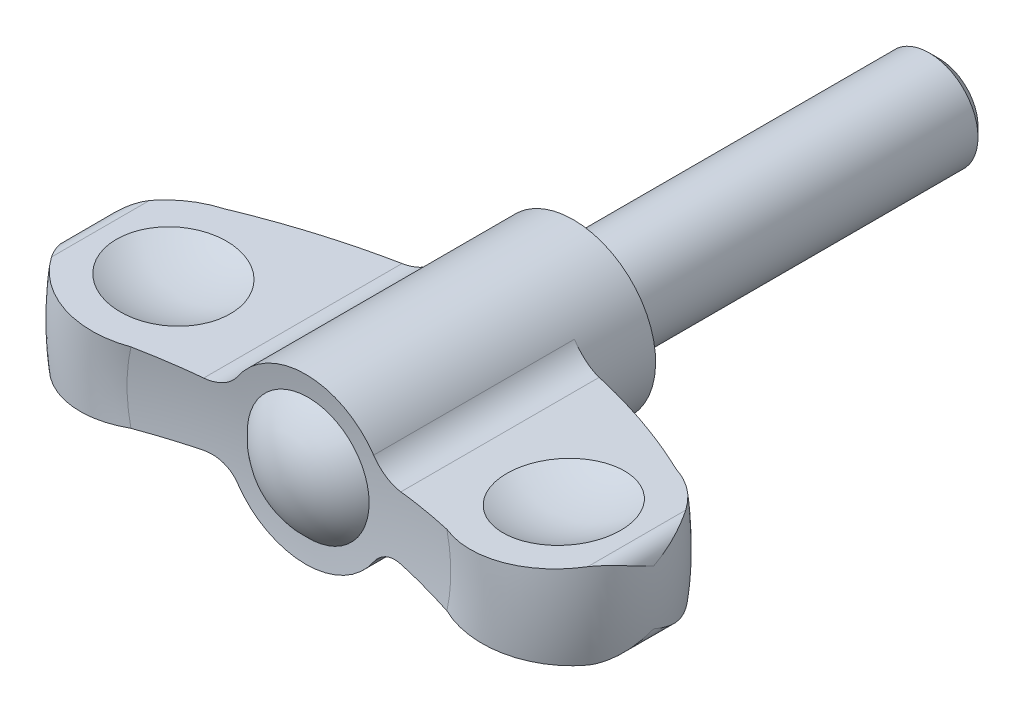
ISO-10303-21;
HEADER;
FILE_DESCRIPTION(('STEP AP214'),'2;1');
FILE_NAME('part.step','',(''),(''),'','','');
FILE_SCHEMA(('AUTOMOTIVE_DESIGN { 1 0 10303 214 1 1 1 1 }'));
ENDSEC;
DATA;
#1=APPLICATION_CONTEXT('core data for automotive mechanical design processes');
#2=APPLICATION_PROTOCOL_DEFINITION('international standard','automotive_design',2000,#1);
#3=PRODUCT_CONTEXT('',#1,'mechanical');
#4=PRODUCT('Part','Part','',(#3));
#5=PRODUCT_RELATED_PRODUCT_CATEGORY('part','',(#4));
#6=PRODUCT_DEFINITION_FORMATION('','',#4);
#7=PRODUCT_DEFINITION_CONTEXT('part definition',#1,'design');
#8=PRODUCT_DEFINITION('design','',#6,#7);
#9=PRODUCT_DEFINITION_SHAPE('','',#8);
#10=(LENGTH_UNIT() NAMED_UNIT(*) SI_UNIT(.MILLI.,.METRE.));
#11=(NAMED_UNIT(*) PLANE_ANGLE_UNIT() SI_UNIT($,.RADIAN.));
#12=(NAMED_UNIT(*) SI_UNIT($,.STERADIAN.) SOLID_ANGLE_UNIT());
#13=UNCERTAINTY_MEASURE_WITH_UNIT(LENGTH_MEASURE(1.E-05),#10,'distance_accuracy_value','');
#14=(GEOMETRIC_REPRESENTATION_CONTEXT(3) GLOBAL_UNCERTAINTY_ASSIGNED_CONTEXT((#13)) GLOBAL_UNIT_ASSIGNED_CONTEXT((#10,
#11,#12)) REPRESENTATION_CONTEXT('',''));
#15=CARTESIAN_POINT('',(0.,0.,0.));
#16=DIRECTION('',(0.,0.,1.));
#17=DIRECTION('',(1.,0.,0.));
#18=AXIS2_PLACEMENT_3D('',#15,#16,#17);
#19=CARTESIAN_POINT('',(0.,0.,60.8916836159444));
#20=DIRECTION('',(0.,0.,1.));
#21=DIRECTION('',(0.,1.,0.));
#22=AXIS2_PLACEMENT_3D('',#19,#20,#21);
#23=DEGENERATE_TOROIDAL_SURFACE('',#22,7.24809636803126,57.1330492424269,.F.);
#24=CARTESIAN_POINT('',(0.,0.,5.5));
#25=DIRECTION('',(0.,0.,1.));
#26=DIRECTION('',(0.,1.,0.));
#27=AXIS2_PLACEMENT_3D('',#24,#25,#26);
#28=CIRCLE('',#27,6.75);
#29=CARTESIAN_POINT('',(5.58468393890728,-3.79128016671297,5.5));
#30=VERTEX_POINT('',#29);
#31=CARTESIAN_POINT('',(5.58468393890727,3.79128016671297,5.5));
#32=VERTEX_POINT('',#31);
#33=EDGE_CURVE('E157',#30,#32,#28,.T.);
#34=ORIENTED_EDGE('',*,*,#33,.T.);
#35=CARTESIAN_POINT('',(5.58454817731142,3.79148016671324,5.5000000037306));
#36=CARTESIAN_POINT('',(5.6270350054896,3.72886637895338,5.49999203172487));
#37=CARTESIAN_POINT('',(5.67207292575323,3.66799067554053,5.50109190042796));
#38=CARTESIAN_POINT('',(5.76687239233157,3.55013742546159,5.50546469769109));
#39=CARTESIAN_POINT('',(5.81663303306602,3.49315913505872,5.5087372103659));
#40=CARTESIAN_POINT('',(5.92037232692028,3.3836500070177,5.51740071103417));
#41=CARTESIAN_POINT('',(5.97433893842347,3.33110730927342,5.5227858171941));
#42=CARTESIAN_POINT('',(6.08617319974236,3.23065312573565,5.53558959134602));
#43=CARTESIAN_POINT('',(6.14404090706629,3.1827417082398,5.54300828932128));
#44=CARTESIAN_POINT('',(6.32281948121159,3.04645743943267,5.56816484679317));
#45=CARTESIAN_POINT('',(6.44903201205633,2.9654018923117,5.58881397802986));
#46=CARTESIAN_POINT('',(6.71175482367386,2.82481579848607,5.63683026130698));
#47=CARTESIAN_POINT('',(6.84827321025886,2.76530241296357,5.66420274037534));
#48=CARTESIAN_POINT('',(7.13180529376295,2.66747892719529,5.72532830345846));
#49=CARTESIAN_POINT('',(7.27900617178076,2.62981214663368,5.75923917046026));
#50=CARTESIAN_POINT('',(7.57631968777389,2.57880440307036,5.83159976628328));
#51=CARTESIAN_POINT('',(7.72642802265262,2.56542990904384,5.87004316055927));
#52=CARTESIAN_POINT('',(7.91146899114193,2.56375196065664,5.91959867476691));
#53=CARTESIAN_POINT('',(7.94691227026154,2.56410633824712,5.92918950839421));
#54=CARTESIAN_POINT('',(8.01766035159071,2.56615563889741,5.94852854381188));
#55=CARTESIAN_POINT('',(8.05296528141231,2.56784856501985,5.958276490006));
#56=CARTESIAN_POINT('',(8.08821506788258,2.57020553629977,5.96810530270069));
#57=B_SPLINE_CURVE_WITH_KNOTS('',3,(#35,#36,#37,#38,#39,#40,#41,#42,#43,#44,#45,#46,#47,#48,#49,
#50,#51,#52,#53,#54,#55,#56),.UNSPECIFIED.,.F.,.F.,(4,2,2,2,2,2,2,2,2,2,4),(0.,
0.226923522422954,0.453803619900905,0.680056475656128,0.906312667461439,1.35828167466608,
1.81060994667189,2.27565813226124,2.74006391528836,2.85020967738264,2.96019142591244),.UNSPECIFIED.);
#58=CARTESIAN_POINT('',(8.08801506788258,2.57019216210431,5.96804953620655));
#59=VERTEX_POINT('',#58);
#60=EDGE_CURVE('E251',#32,#59,#57,.T.);
#61=ORIENTED_EDGE('',*,*,#60,.T.);
#62=CARTESIAN_POINT('',(18.5568278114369,3.2698755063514,10.0639861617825));
#63=CARTESIAN_POINT('',(17.7202118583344,3.21396025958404,9.63606709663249));
#64=CARTESIAN_POINT('',(16.8730027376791,3.15733701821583,9.22898268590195));
#65=CARTESIAN_POINT('',(15.1615683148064,3.04295325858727,8.45851890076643));
#66=CARTESIAN_POINT('',(14.2973907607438,2.98519593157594,8.09503297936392));
#67=CARTESIAN_POINT('',(12.5519653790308,2.86854038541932,7.41164455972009));
#68=CARTESIAN_POINT('',(11.6707170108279,2.80964213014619,7.09174344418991));
#69=CARTESIAN_POINT('',(10.3366076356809,2.72047689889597,6.64515483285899));
#70=CARTESIAN_POINT('',(9.88928279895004,2.6905799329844,6.5016730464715));
#71=CARTESIAN_POINT('',(8.99112522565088,2.63055155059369,6.22618011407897));
#72=CARTESIAN_POINT('',(8.54029244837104,2.6004201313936,6.0941691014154));
#73=CARTESIAN_POINT('',(8.08781506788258,2.57017879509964,5.96799377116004));
#74=B_SPLINE_CURVE_WITH_KNOTS('',3,(#62,#63,#64,#65,#66,#67,#68,#69,#70,#71,#72,#73),
.UNSPECIFIED.,.F.,.F.,(4,2,2,2,2,4),(0.,2.82377208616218,5.64049635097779,8.45730995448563,
9.86934742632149,11.2814013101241),.UNSPECIFIED.);
#75=CARTESIAN_POINT('',(18.5564367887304,3.26984937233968,10.0637861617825));
#76=VERTEX_POINT('',#75);
#77=EDGE_CURVE('E242',#76,#59,#74,.T.);
#78=ORIENTED_EDGE('',*,*,#77,.F.);
#79=CARTESIAN_POINT('',(0.,0.,10.0637861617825));
#80=DIRECTION('',(0.,0.,1.));
#81=DIRECTION('',(0.,1.,0.));
#82=AXIS2_PLACEMENT_3D('',#79,#80,#81);
#83=CIRCLE('',#82,18.8423263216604);
#84=CARTESIAN_POINT('',(18.5564367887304,-3.26984937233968,10.0637861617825));
#85=VERTEX_POINT('',#84);
#86=EDGE_CURVE('E402',#85,#76,#83,.T.);
#87=ORIENTED_EDGE('',*,*,#86,.F.);
#88=CARTESIAN_POINT('',(8.08781506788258,-2.57017879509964,5.96799377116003));
#89=CARTESIAN_POINT('',(8.43648524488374,-2.59348217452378,6.06521586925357));
#90=CARTESIAN_POINT('',(8.78418982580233,-2.6167210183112,6.16591362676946));
#91=CARTESIAN_POINT('',(9.47752423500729,-2.66306003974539,6.37414417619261));
#92=CARTESIAN_POINT('',(9.82315423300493,-2.68616022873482,6.48167640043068));
#93=CARTESIAN_POINT('',(10.8568675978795,-2.7552484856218,6.81439605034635));
#94=CARTESIAN_POINT('',(11.5417095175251,-2.80101991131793,7.04968835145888));
#95=CARTESIAN_POINT('',(13.5766416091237,-2.93702464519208,7.79319141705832));
#96=CARTESIAN_POINT('',(14.9128146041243,-3.02632779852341,8.34061833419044));
#97=CARTESIAN_POINT('',(16.6182429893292,-3.14031014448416,9.11672807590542));
#98=CARTESIAN_POINT('',(17.0086949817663,-3.16640601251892,9.29983650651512));
#99=CARTESIAN_POINT('',(17.785774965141,-3.21834217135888,9.67514693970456));
#100=CARTESIAN_POINT('',(18.1723980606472,-3.24418213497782,9.86735912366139));
#101=CARTESIAN_POINT('',(18.5568278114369,-3.2698755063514,10.0639861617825));
#102=B_SPLINE_CURVE_WITH_KNOTS('',3,(#88,#89,#90,#91,#92,#93,#94,#95,#96,#97,#98,#99,#100,#101),
.UNSPECIFIED.,.F.,.F.,(4,2,2,2,2,2,4),(0.,1.0881425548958,2.17619484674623,4.35250158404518,
8.68743833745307,9.98350841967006,11.2810638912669),.UNSPECIFIED.);
#103=CARTESIAN_POINT('',(8.08801506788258,-2.57019216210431,5.96804953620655));
#104=VERTEX_POINT('',#103);
#105=EDGE_CURVE('E232',#104,#85,#102,.T.);
#106=ORIENTED_EDGE('',*,*,#105,.F.);
#107=CARTESIAN_POINT('',(8.08821506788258,-2.57020553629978,5.96810530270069));
#108=CARTESIAN_POINT('',(8.00997344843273,-2.56497338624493,5.94629000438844));
#109=CARTESIAN_POINT('',(7.9314394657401,-2.5630200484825,5.92486614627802));
#110=CARTESIAN_POINT('',(7.77422277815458,-2.56573749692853,5.88295181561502));
#111=CARTESIAN_POINT('',(7.69554004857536,-2.57040950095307,5.862461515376));
#112=CARTESIAN_POINT('',(7.45993217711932,-2.59446790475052,5.80261995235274));
#113=CARTESIAN_POINT('',(7.30348188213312,-2.62389903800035,5.7649076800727));
#114=CARTESIAN_POINT('',(6.99637317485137,-2.7094115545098,5.69535012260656));
#115=CARTESIAN_POINT('',(6.84572761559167,-2.76554877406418,5.66351732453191));
#116=CARTESIAN_POINT('',(6.55526150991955,-2.90348395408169,5.60733410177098));
#117=CARTESIAN_POINT('',(6.4154250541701,-2.98524327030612,5.58297251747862));
#118=CARTESIAN_POINT('',(6.21564820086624,-3.12665619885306,5.55280138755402));
#119=CARTESIAN_POINT('',(6.14994832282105,-3.17769981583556,5.54373343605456));
#120=CARTESIAN_POINT('',(6.0231628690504,-3.28560819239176,5.52805647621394));
#121=CARTESIAN_POINT('',(5.96207731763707,-3.34247298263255,5.5214474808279));
#122=CARTESIAN_POINT('',(5.84481263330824,-3.46187538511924,5.51078652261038));
#123=CARTESIAN_POINT('',(5.78866161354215,-3.52444182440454,5.50674848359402));
#124=CARTESIAN_POINT('',(5.68213708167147,-3.65444758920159,5.50134928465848));
#125=CARTESIAN_POINT('',(5.63176510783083,-3.72188820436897,5.49998883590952));
#126=CARTESIAN_POINT('',(5.58454817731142,-3.79148016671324,5.50000000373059));
#127=B_SPLINE_CURVE_WITH_KNOTS('',3,(#107,#108,#109,#110,#111,#112,#113,#114,#115,#116,#117,
#118,#119,#120,#121,#122,#123,#124,#125,#126),.UNSPECIFIED.,.F.,.F.,(4,2,2,2,2,2,2,2,2,4),(0.,
0.244043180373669,0.488131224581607,0.976413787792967,1.46572175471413,1.95429525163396,
2.20506346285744,2.4558329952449,2.70794934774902,2.96013265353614),.UNSPECIFIED.);
#128=EDGE_CURVE('E222',#104,#30,#127,.T.);
#129=ORIENTED_EDGE('',*,*,#128,.T.);
#130=EDGE_LOOP('',(#34,#61,#78,#87,#106,#129));
#131=FACE_BOUND('',#130,.T.);
#132=ADVANCED_FACE('F14',(#131),#23,.F.);
#133=CARTESIAN_POINT('',(0.,0.,16.8));
#134=DIRECTION('',(0.,0.,1.));
#135=DIRECTION('',(0.,1.,0.));
#136=AXIS2_PLACEMENT_3D('',#133,#134,#135);
#137=TOROIDAL_SURFACE('',#136,16.3,7.2);
#138=CARTESIAN_POINT('',(-13.4430070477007,-2.92809317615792,10.0635861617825));
#139=CARTESIAN_POINT('',(-13.250045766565,-2.91519660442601,10.1357408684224));
#140=CARTESIAN_POINT('',(-13.0601324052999,-2.90250374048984,10.216071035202));
#141=CARTESIAN_POINT('',(-12.6877100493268,-2.8776128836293,10.3924240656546));
#142=CARTESIAN_POINT('',(-12.5052008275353,-2.86541487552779,10.4884464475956));
#143=CARTESIAN_POINT('',(-12.1489194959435,-2.84160280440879,10.6955091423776));
#144=CARTESIAN_POINT('',(-11.9751456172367,-2.8299886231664,10.8065463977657));
#145=CARTESIAN_POINT('',(-11.6375334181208,-2.8074243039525,11.042874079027));
#146=CARTESIAN_POINT('',(-11.47369496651,-2.79647415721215,11.1681643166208));
#147=CARTESIAN_POINT('',(-11.1570734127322,-2.77531274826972,11.4321870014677));
#148=CARTESIAN_POINT('',(-11.0042945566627,-2.76510176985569,11.5709245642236));
#149=CARTESIAN_POINT('',(-10.7109328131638,-2.74549493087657,11.8608983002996));
#150=CARTESIAN_POINT('',(-10.570354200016,-2.73609935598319,12.0121388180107));
#151=CARTESIAN_POINT('',(-10.3025713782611,-2.7182020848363,12.3259661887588));
#152=CARTESIAN_POINT('',(-10.1753613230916,-2.70969999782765,12.4885480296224));
#153=CARTESIAN_POINT('',(-9.93523518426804,-2.69365116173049,12.8239887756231));
#154=CARTESIAN_POINT('',(-9.82231883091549,-2.68610439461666,12.9968474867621));
#155=CARTESIAN_POINT('',(-9.61240942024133,-2.67207509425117,13.3504168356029));
#156=CARTESIAN_POINT('',(-9.51531257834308,-2.6655856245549,13.5310655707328));
#157=CARTESIAN_POINT('',(-9.33694719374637,-2.6536645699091,13.8999735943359));
#158=CARTESIAN_POINT('',(-9.2556730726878,-2.64823261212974,14.0882301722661));
#159=CARTESIAN_POINT('',(-9.10959731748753,-2.63846963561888,14.4711021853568));
#160=CARTESIAN_POINT('',(-9.0447989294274,-2.63413883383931,14.6657188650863));
#161=CARTESIAN_POINT('',(-8.93227844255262,-2.62661852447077,15.0598492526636));
#162=CARTESIAN_POINT('',(-8.88455601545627,-2.62342899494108,15.2593628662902));
#163=CARTESIAN_POINT('',(-8.80746852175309,-2.61827685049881,15.6574650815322));
#164=CARTESIAN_POINT('',(-8.77773054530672,-2.6162893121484,15.8559812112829));
#165=CARTESIAN_POINT('',(-8.73529826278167,-2.6134533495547,16.2548338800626));
#166=CARTESIAN_POINT('',(-8.7226036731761,-2.61260490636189,16.4551703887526));
#167=CARTESIAN_POINT('',(-8.71437606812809,-2.61205501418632,16.8561671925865));
#168=CARTESIAN_POINT('',(-8.71884052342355,-2.61235339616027,17.0568274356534));
#169=CARTESIAN_POINT('',(-8.74488386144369,-2.61409400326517,17.4570282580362));
#170=CARTESIAN_POINT('',(-8.76646264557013,-2.6155362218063,17.6565688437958));
#171=CARTESIAN_POINT('',(-8.82608238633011,-2.6195209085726,18.0500864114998));
#172=CARTESIAN_POINT('',(-8.86387061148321,-2.62204648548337,18.2441019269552));
#173=CARTESIAN_POINT('',(-8.95554073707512,-2.62817326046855,18.6283441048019));
#174=CARTESIAN_POINT('',(-9.00942811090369,-2.63177482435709,18.8185694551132));
#175=CARTESIAN_POINT('',(-9.13281555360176,-2.64002142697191,19.1937999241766));
#176=CARTESIAN_POINT('',(-9.20231107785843,-2.64466616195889,19.3788065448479));
#177=CARTESIAN_POINT('',(-9.35638258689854,-2.6549635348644,19.742479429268));
#178=CARTESIAN_POINT('',(-9.44096421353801,-2.66061654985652,19.9211432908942));
#179=CARTESIAN_POINT('',(-9.62545322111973,-2.67294687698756,20.2726485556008));
#180=CARTESIAN_POINT('',(-9.72550696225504,-2.6796339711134,20.4454127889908));
#181=CARTESIAN_POINT('',(-9.93957002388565,-2.69394088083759,20.7821124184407));
#182=CARTESIAN_POINT('',(-10.0535844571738,-2.70156103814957,20.9460445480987));
#183=CARTESIAN_POINT('',(-10.2946584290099,-2.71767322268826,21.263898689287));
#184=CARTESIAN_POINT('',(-10.4217143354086,-2.7261650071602,21.4178234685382));
#185=CARTESIAN_POINT('',(-10.688029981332,-2.74396421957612,21.7147703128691));
#186=CARTESIAN_POINT('',(-10.8272940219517,-2.75327193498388,21.8577885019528));
#187=CARTESIAN_POINT('',(-11.1201972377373,-2.77284812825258,22.1349543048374));
#188=CARTESIAN_POINT('',(-11.2740848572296,-2.78313321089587,22.2688382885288));
#189=CARTESIAN_POINT('',(-11.5924511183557,-2.80441122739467,22.5232972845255));
#190=CARTESIAN_POINT('',(-11.7569299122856,-2.81540417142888,22.6438721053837));
#191=CARTESIAN_POINT('',(-12.0953583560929,-2.83802304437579,22.8709220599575));
#192=CARTESIAN_POINT('',(-12.2693100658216,-2.84964911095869,22.9773941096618));
#193=CARTESIAN_POINT('',(-12.6253835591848,-2.87344729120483,23.175449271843));
#194=CARTESIAN_POINT('',(-12.8075027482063,-2.88561923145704,23.2670370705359));
#195=CARTESIAN_POINT('',(-13.1810420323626,-2.9105847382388,23.4357878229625));
#196=CARTESIAN_POINT('',(-13.37255033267,-2.92338419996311,23.5127547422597));
#197=CARTESIAN_POINT('',(-13.7613485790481,-2.94936953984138,23.6502587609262));
#198=CARTESIAN_POINT('',(-13.9586384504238,-2.96255541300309,23.7107960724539));
#199=CARTESIAN_POINT('',(-14.3576152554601,-2.98922103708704,23.8149976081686));
#200=CARTESIAN_POINT('',(-14.5593023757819,-3.00270080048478,23.8586611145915));
#201=CARTESIAN_POINT('',(-14.9656299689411,-3.02985771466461,23.9287762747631));
#202=CARTESIAN_POINT('',(-15.170270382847,-3.04353486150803,23.9552282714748));
#203=CARTESIAN_POINT('',(-15.5810553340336,-3.07098968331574,23.9907056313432));
#204=CARTESIAN_POINT('',(-15.7871999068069,-3.08476736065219,23.9997305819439));
#205=CARTESIAN_POINT('',(-16.1994347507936,-3.11231908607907,24.000257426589));
#206=CARTESIAN_POINT('',(-16.4055250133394,-3.1260931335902,23.9917658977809));
#207=CARTESIAN_POINT('',(-16.816299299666,-3.15354724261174,23.9572980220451));
#208=CARTESIAN_POINT('',(-17.0209829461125,-3.16722727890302,23.9313171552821));
#209=CARTESIAN_POINT('',(-17.4273317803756,-3.19438561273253,23.8620348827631));
#210=CARTESIAN_POINT('',(-17.6289980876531,-3.20786398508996,23.8187400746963));
#211=CARTESIAN_POINT('',(-18.0267250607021,-3.23444607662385,23.7154246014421));
#212=CARTESIAN_POINT('',(-18.2228121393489,-3.24755156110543,23.6555060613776));
#213=CARTESIAN_POINT('',(-18.6091495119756,-3.27337242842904,23.5192613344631));
#214=CARTESIAN_POINT('',(-18.7994018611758,-3.28608794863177,23.4429410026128));
#215=CARTESIAN_POINT('',(-19.1728922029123,-3.31105018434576,23.2743446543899));
#216=CARTESIAN_POINT('',(-19.3561252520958,-3.32329656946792,23.1820576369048));
#217=CARTESIAN_POINT('',(-19.7140940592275,-3.34722142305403,22.9822113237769));
#218=CARTESIAN_POINT('',(-19.8888301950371,-3.35889991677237,22.8746527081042));
#219=CARTESIAN_POINT('',(-20.2275235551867,-3.38153649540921,22.6457025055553));
#220=CARTESIAN_POINT('',(-20.3915386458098,-3.39249844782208,22.5243968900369));
#221=CARTESIAN_POINT('',(-20.7087215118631,-3.41369737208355,22.2682963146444));
#222=CARTESIAN_POINT('',(-20.8618896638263,-3.42393436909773,22.133501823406));
#223=CARTESIAN_POINT('',(-21.1559703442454,-3.44358925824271,21.851664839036));
#224=CARTESIAN_POINT('',(-21.296906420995,-3.45300872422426,21.704646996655));
#225=CARTESIAN_POINT('',(-21.565777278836,-3.47097871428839,21.3992346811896));
#226=CARTESIAN_POINT('',(-21.6937203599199,-3.47952979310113,21.240847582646));
#227=CARTESIAN_POINT('',(-21.8466005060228,-3.48974754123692,21.0342564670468));
#228=CARTESIAN_POINT('',(-21.8780226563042,-3.49184764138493,20.9907857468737));
#229=CARTESIAN_POINT('',(-21.9398602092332,-3.49598055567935,20.9031903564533));
#230=CARTESIAN_POINT('',(-21.9702765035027,-3.49801342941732,20.8590663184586));
#231=CARTESIAN_POINT('',(-22.0002000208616,-3.50001336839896,20.8146028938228));
#232=B_SPLINE_CURVE_WITH_KNOTS('',3,(#138,#139,#140,#141,#142,#143,#144,#145,#146,#147,#148,
#149,#150,#151,#152,#153,#154,#155,#156,#157,#158,#159,#160,#161,#162,#163,#164,#165,#166,#167,
#168,#169,#170,#171,#172,#173,#174,#175,#176,#177,#178,#179,#180,#181,#182,#183,#184,#185,#186,
#187,#188,#189,#190,#191,#192,#193,#194,#195,#196,#197,#198,#199,#200,#201,#202,#203,#204,#205,
#206,#207,#208,#209,#210,#211,#212,#213,#214,#215,#216,#217,#218,#219,#220,#221,#222,#223,#224,
#225,#226,#227,#228,#229,#230,#231),.UNSPECIFIED.,.F.,.F.,(4,2,2,2,2,2,2,2,2,2,2,2,2,2,2,2,2,2,
2,2,2,2,2,2,2,2,2,2,2,2,2,2,2,2,2,2,2,2,2,2,2,2,2,2,2,2,4),(0.,0.619053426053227,
1.23808785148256,1.85699641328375,2.47589680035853,3.09503355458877,3.71438635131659,
4.33346714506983,4.95253625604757,5.56736438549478,6.18197536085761,6.79670733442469,
7.41142748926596,8.01292036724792,8.61440323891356,9.21579745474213,9.81718820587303,
10.4095249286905,11.0020632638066,11.5944292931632,12.1870173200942,12.7855991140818,
13.3844007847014,13.9830361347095,14.5818832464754,15.1938756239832,15.8058768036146,
16.4180115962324,17.029953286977,17.6495959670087,18.2692306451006,18.8888916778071,
19.5085403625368,20.1282037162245,20.7476344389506,21.3672253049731,21.9865802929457,
22.6022115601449,23.217623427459,23.8334610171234,24.4492711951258,25.0614231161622,
25.6735537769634,26.2844785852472,26.8950106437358,27.0560402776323,27.216923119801),.UNSPECIFIED.);
#233=CARTESIAN_POINT('',(-12.9627653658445,-2.89599621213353,23.3370956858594));
#234=VERTEX_POINT('',#233);
#235=CARTESIAN_POINT('',(-22.0000000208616,-3.5,20.8149000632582));
#236=VERTEX_POINT('',#235);
#237=EDGE_CURVE('E276',#234,#236,#232,.T.);
#238=ORIENTED_EDGE('',*,*,#237,.F.);
#239=CARTESIAN_POINT('',(0.,0.,23.3370956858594));
#240=DIRECTION('',(0.,0.,1.));
#241=DIRECTION('',(0.,1.,0.));
#242=AXIS2_PLACEMENT_3D('',#239,#240,#241);
#243=CIRCLE('',#242,13.2823220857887);
#244=CARTESIAN_POINT('',(-12.9627653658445,2.89599621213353,23.3370956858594));
#245=VERTEX_POINT('',#244);
#246=EDGE_CURVE('E210',#245,#234,#243,.T.);
#247=ORIENTED_EDGE('',*,*,#246,.F.);
#248=CARTESIAN_POINT('',(-22.0002,3.50001336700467,20.8146029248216));
#249=CARTESIAN_POINT('',(-21.8869659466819,3.49244536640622,20.9829001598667));
#250=CARTESIAN_POINT('',(-21.7665908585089,3.48440009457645,21.1463645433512));
#251=CARTESIAN_POINT('',(-21.5125154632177,3.46741895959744,21.4625195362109));
#252=CARTESIAN_POINT('',(-21.378816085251,3.45848315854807,21.6152108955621));
#253=CARTESIAN_POINT('',(-21.0991608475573,3.43979239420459,21.9086013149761));
#254=CARTESIAN_POINT('',(-20.9532163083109,3.43003818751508,22.0493112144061));
#255=CARTESIAN_POINT('',(-20.6500231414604,3.4097742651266,22.3179109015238));
#256=CARTESIAN_POINT('',(-20.4927745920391,3.399264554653,22.445800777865));
#257=CARTESIAN_POINT('',(-20.1680719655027,3.377563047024,22.6878898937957));
#258=CARTESIAN_POINT('',(-20.0006161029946,3.36637113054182,22.8020867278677));
#259=CARTESIAN_POINT('',(-19.6566594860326,3.34338278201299,23.0160136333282));
#260=CARTESIAN_POINT('',(-19.4801554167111,3.33158612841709,23.1157383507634));
#261=CARTESIAN_POINT('',(-19.1195107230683,3.3074824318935,23.299940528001));
#262=CARTESIAN_POINT('',(-18.9353740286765,3.29517565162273,23.3844257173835));
#263=CARTESIAN_POINT('',(-18.5606181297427,3.27012883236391,23.5376689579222));
#264=CARTESIAN_POINT('',(-18.369996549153,3.25738863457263,23.6064211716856));
#265=CARTESIAN_POINT('',(-17.9830362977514,3.23152613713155,23.7279050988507));
#266=CARTESIAN_POINT('',(-17.7866806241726,3.21840270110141,23.780582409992));
#267=CARTESIAN_POINT('',(-17.3901835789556,3.19190281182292,23.8692781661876));
#268=CARTESIAN_POINT('',(-17.1900408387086,3.17852626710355,23.9052904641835));
#269=CARTESIAN_POINT('',(-16.7874574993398,3.15161960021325,23.9604036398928));
#270=CARTESIAN_POINT('',(-16.5850169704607,3.13808948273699,23.9795050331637));
#271=CARTESIAN_POINT('',(-16.1792478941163,3.11096989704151,24.0006952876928));
#272=CARTESIAN_POINT('',(-15.9759193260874,3.09738042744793,24.0027837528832));
#273=CARTESIAN_POINT('',(-15.5684666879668,3.07014832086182,23.9899203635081));
#274=CARTESIAN_POINT('',(-15.364346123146,3.05650591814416,23.9748568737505));
#275=CARTESIAN_POINT('',(-14.9580777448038,3.02935296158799,23.9276425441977));
#276=CARTESIAN_POINT('',(-14.755929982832,3.01584241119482,23.8954912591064));
#277=CARTESIAN_POINT('',(-14.3550670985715,2.98905073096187,23.814360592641));
#278=CARTESIAN_POINT('',(-14.1563513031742,2.97576955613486,23.7653845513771));
#279=CARTESIAN_POINT('',(-13.7636331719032,2.94952223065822,23.6509482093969));
#280=CARTESIAN_POINT('',(-13.5696323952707,2.9365561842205,23.5854825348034));
#281=CARTESIAN_POINT('',(-13.1865164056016,2.91095061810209,23.4380671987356));
#282=CARTESIAN_POINT('',(-12.9974412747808,2.89831377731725,23.356012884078));
#283=CARTESIAN_POINT('',(-12.6268363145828,2.87354438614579,23.1762764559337));
#284=CARTESIAN_POINT('',(-12.4453065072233,2.86141183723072,23.078594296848));
#285=CARTESIAN_POINT('',(-12.0910342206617,2.83773404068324,22.8682633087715));
#286=CARTESIAN_POINT('',(-11.9182938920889,2.8261889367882,22.7556108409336));
#287=CARTESIAN_POINT('',(-11.5829402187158,2.80377556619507,22.516182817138));
#288=CARTESIAN_POINT('',(-11.4203233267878,2.79290706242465,22.3894122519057));
#289=CARTESIAN_POINT('',(-11.1059013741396,2.77189266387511,22.1222291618));
#290=CARTESIAN_POINT('',(-10.9541266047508,2.76174879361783,21.9817808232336));
#291=CARTESIAN_POINT('',(-10.6630509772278,2.74229474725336,21.6885550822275));
#292=CARTESIAN_POINT('',(-10.5237454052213,2.73298425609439,21.5357823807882));
#293=CARTESIAN_POINT('',(-10.2585504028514,2.71525994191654,21.2188580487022));
#294=CARTESIAN_POINT('',(-10.1326659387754,2.7068464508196,21.0547022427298));
#295=CARTESIAN_POINT('',(-9.89540453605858,2.69098907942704,20.7162706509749));
#296=CARTESIAN_POINT('',(-9.78402188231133,2.68354481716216,20.5419988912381));
#297=CARTESIAN_POINT('',(-9.57753567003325,2.66974430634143,20.1860989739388));
#298=CARTESIAN_POINT('',(-9.48229586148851,2.66337895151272,20.0045502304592));
#299=CARTESIAN_POINT('',(-9.30772151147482,2.65171127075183,19.6340070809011));
#300=CARTESIAN_POINT('',(-9.22838099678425,2.64640854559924,19.445015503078));
#301=CARTESIAN_POINT('',(-9.0862443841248,2.6369088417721,19.0608700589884));
#302=CARTESIAN_POINT('',(-9.02344908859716,2.63271191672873,18.8657158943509));
#303=CARTESIAN_POINT('',(-8.91497467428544,2.62546202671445,18.4706862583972));
#304=CARTESIAN_POINT('',(-8.86929523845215,2.62240904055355,18.2708108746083));
#305=CARTESIAN_POINT('',(-8.79627719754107,2.61752887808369,17.8722020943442));
#306=CARTESIAN_POINT('',(-8.76856256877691,2.61567657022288,17.6735378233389));
#307=CARTESIAN_POINT('',(-8.73017446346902,2.61311090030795,17.2745631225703));
#308=CARTESIAN_POINT('',(-8.71950071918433,2.61239752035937,17.0742527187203));
#309=CARTESIAN_POINT('',(-8.71529310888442,2.61211630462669,16.6734663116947));
#310=CARTESIAN_POINT('',(-8.72175798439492,2.61254838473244,16.4729903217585));
#311=CARTESIAN_POINT('',(-8.75176494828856,2.61455390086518,16.0733272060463));
#312=CARTESIAN_POINT('',(-8.77530694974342,2.61612733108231,15.8741400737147));
#313=CARTESIAN_POINT('',(-8.83878915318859,2.62037016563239,15.481363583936));
#314=CARTESIAN_POINT('',(-8.87848770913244,2.62302341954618,15.2877349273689));
#315=CARTESIAN_POINT('',(-8.97393104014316,2.62940237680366,14.9044232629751));
#316=CARTESIAN_POINT('',(-9.029681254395,2.6331284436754,14.7147416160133));
#317=CARTESIAN_POINT('',(-9.15673580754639,2.64162013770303,14.3407362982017));
#318=CARTESIAN_POINT('',(-9.2280365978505,2.64638552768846,14.1564114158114));
#319=CARTESIAN_POINT('',(-9.38562068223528,2.65691766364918,13.7943056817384));
#320=CARTESIAN_POINT('',(-9.47190458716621,2.66268445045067,13.6165250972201));
#321=CARTESIAN_POINT('',(-9.65980249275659,2.67524261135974,13.2667770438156));
#322=CARTESIAN_POINT('',(-9.76157423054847,2.68204452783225,13.094894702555));
#323=CARTESIAN_POINT('',(-9.97895442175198,2.69657313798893,12.7601587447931));
#324=CARTESIAN_POINT('',(-10.094562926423,2.70429983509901,12.5973051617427));
#325=CARTESIAN_POINT('',(-10.3388280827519,2.72062530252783,12.28159984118));
#326=CARTESIAN_POINT('',(-10.4674919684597,2.72922455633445,12.1287537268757));
#327=CARTESIAN_POINT('',(-10.7368892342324,2.74722972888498,11.8341521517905));
#328=CARTESIAN_POINT('',(-10.8776225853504,2.75663564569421,11.6923966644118));
#329=CARTESIAN_POINT('',(-11.1735584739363,2.77641452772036,11.4177499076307));
#330=CARTESIAN_POINT('',(-11.3290201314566,2.78680481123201,11.2851390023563));
#331=CARTESIAN_POINT('',(-11.6503816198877,2.80828301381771,11.0334204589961));
#332=CARTESIAN_POINT('',(-11.8162777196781,2.81937068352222,10.914308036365));
#333=CARTESIAN_POINT('',(-12.1571151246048,2.8421505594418,10.690516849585));
#334=CARTESIAN_POINT('',(-12.3320419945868,2.85384180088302,10.5858159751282));
#335=CARTESIAN_POINT('',(-12.6898958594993,2.87775897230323,10.3913862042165));
#336=CARTESIAN_POINT('',(-12.8728180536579,2.88998458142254,10.3016484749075));
#337=CARTESIAN_POINT('',(-13.1223586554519,2.90666263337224,10.1918600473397));
#338=CARTESIAN_POINT('',(-13.1860214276,2.9109175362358,10.1649193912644));
#339=CARTESIAN_POINT('',(-13.3140099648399,2.91947165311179,10.1128788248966));
#340=CARTESIAN_POINT('',(-13.3783349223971,2.92377081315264,10.0877769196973));
#341=CARTESIAN_POINT('',(-13.4430070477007,2.92809317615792,10.0635861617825));
#342=B_SPLINE_CURVE_WITH_KNOTS('',3,(#248,#249,#250,#251,#252,#253,#254,#255,#256,#257,#258,
#259,#260,#261,#262,#263,#264,#265,#266,#267,#268,#269,#270,#271,#272,#273,#274,#275,#276,#277,
#278,#279,#280,#281,#282,#283,#284,#285,#286,#287,#288,#289,#290,#291,#292,#293,#294,#295,#296,
#297,#298,#299,#300,#301,#302,#303,#304,#305,#306,#307,#308,#309,#310,#311,#312,#313,#314,#315,
#316,#317,#318,#319,#320,#321,#322,#323,#324,#325,#326,#327,#328,#329,#330,#331,#332,#333,#334,
#335,#336,#337,#338,#339,#340,#341),.UNSPECIFIED.,.F.,.F.,(4,2,2,2,2,2,2,2,2,2,2,2,2,2,2,2,2,2,
2,2,2,2,2,2,2,2,2,2,2,2,2,2,2,2,2,2,2,2,2,2,2,2,2,2,2,2,4),(0.,0.608767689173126,
1.21749295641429,1.82566153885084,2.43382591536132,3.04209697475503,3.65059249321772,
4.25877850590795,4.86718980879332,5.47763788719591,6.08831095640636,6.698965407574,
7.30963407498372,7.92430017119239,8.53898228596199,9.15354244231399,9.76830314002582,
10.387070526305,11.0058397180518,11.6247595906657,12.2434613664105,12.8638290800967,
13.4839612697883,14.1043221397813,14.7244377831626,15.3390262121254,15.9533833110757,
16.5677702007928,17.1821457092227,17.7832066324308,18.3842581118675,18.9852654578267,
19.5862697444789,20.1785973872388,20.7711259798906,21.3635195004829,21.9559371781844,
22.5548514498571,23.1537679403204,23.7530181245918,24.3522668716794,24.9653566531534,
25.5782284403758,26.1901492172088,26.8017074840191,27.0094652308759,27.2169941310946),.UNSPECIFIED.);
#343=CARTESIAN_POINT('',(-22.,3.5,20.8149000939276));
#344=VERTEX_POINT('',#343);
#345=EDGE_CURVE('E298',#344,#245,#342,.T.);
#346=ORIENTED_EDGE('',*,*,#345,.F.);
#347=CARTESIAN_POINT('',(-23.3936651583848,2.23303167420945,16.8));
#348=CARTESIAN_POINT('',(-23.3934426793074,2.23536251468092,16.8051493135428));
#349=CARTESIAN_POINT('',(-23.3932143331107,2.23769289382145,16.8102988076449));
#350=CARTESIAN_POINT('',(-23.3743145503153,2.42570445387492,17.2258528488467));
#351=CARTESIAN_POINT('',(-23.3183956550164,2.60830531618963,17.6373544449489));
#352=CARTESIAN_POINT('',(-23.1798743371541,2.85965877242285,18.2505518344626));
#353=CARTESIAN_POINT('',(-23.1245479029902,2.939723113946,18.4543861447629));
#354=CARTESIAN_POINT('',(-22.9956909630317,3.08909813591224,18.8603432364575));
#355=CARTESIAN_POINT('',(-22.9221687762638,3.1584137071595,19.0624667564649));
#356=CARTESIAN_POINT('',(-22.7850793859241,3.26116367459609,19.3959296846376));
#357=CARTESIAN_POINT('',(-22.7265638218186,3.29880232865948,19.5280746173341));
#358=CARTESIAN_POINT('',(-22.6018254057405,3.36602668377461,19.7906656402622));
#359=CARTESIAN_POINT('',(-22.5356088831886,3.39561893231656,19.9211130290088));
#360=CARTESIAN_POINT('',(-22.395316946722,3.44509635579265,20.180513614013));
#361=CARTESIAN_POINT('',(-22.3212053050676,3.46493421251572,20.3094566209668));
#362=CARTESIAN_POINT('',(-22.2046559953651,3.48552373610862,20.500765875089));
#363=CARTESIAN_POINT('',(-22.1648550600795,3.49085996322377,20.5642643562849));
#364=CARTESIAN_POINT('',(-22.0835651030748,3.49809816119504,20.6904076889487));
#365=CARTESIAN_POINT('',(-22.0420753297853,3.49999858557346,20.7530521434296));
#366=CARTESIAN_POINT('',(-21.9998,3.49999998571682,20.8151941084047));
#367=B_SPLINE_CURVE_WITH_KNOTS('',3,(#347,#348,#349,#350,#351,#352,#353,#354,#355,#356,#357,
#358,#359,#360,#361,#362,#363,#364,#365,#366),.UNSPECIFIED.,.F.,.F.,(4,2,2,2,2,2,2,2,2,4),(0.,
0.016970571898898,1.36944581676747,2.04642868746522,2.72310261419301,3.17077232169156,
3.61807665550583,4.06752995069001,4.29283181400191,4.51823506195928),.UNSPECIFIED.);
#368=CARTESIAN_POINT('',(-23.3936651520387,2.23303174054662,16.8));
#369=VERTEX_POINT('',#368);
#370=EDGE_CURVE('E360',#369,#344,#367,.T.);
#371=ORIENTED_EDGE('',*,*,#370,.F.);
#372=CARTESIAN_POINT('',(-21.9998,3.49999998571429,12.7848058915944));
#373=CARTESIAN_POINT('',(-22.0666741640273,3.49996244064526,12.8830879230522));
#374=CARTESIAN_POINT('',(-22.1315514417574,3.4952325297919,12.9826100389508));
#375=CARTESIAN_POINT('',(-22.2568815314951,3.47769367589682,13.1835115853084));
#376=CARTESIAN_POINT('',(-22.3173409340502,3.46489705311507,13.2848879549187));
#377=CARTESIAN_POINT('',(-22.4333648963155,3.43259083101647,13.4887461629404));
#378=CARTESIAN_POINT('',(-22.4889490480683,3.41310980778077,13.5912215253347));
#379=CARTESIAN_POINT('',(-22.5953729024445,3.3684102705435,13.7974289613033));
#380=CARTESIAN_POINT('',(-22.6462099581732,3.34318858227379,13.9011616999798));
#381=CARTESIAN_POINT('',(-22.774089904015,3.2701146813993,14.1765334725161));
#382=CARTESIAN_POINT('',(-22.8470051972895,3.21812877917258,14.3490158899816));
#383=CARTESIAN_POINT('',(-22.9794561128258,3.10414337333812,14.695745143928));
#384=CARTESIAN_POINT('',(-23.0389856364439,3.04213932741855,14.8699927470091));
#385=CARTESIAN_POINT('',(-23.1975205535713,2.84462859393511,15.3951794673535));
#386=CARTESIAN_POINT('',(-23.2763283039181,2.6977147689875,15.7482515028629));
#387=CARTESIAN_POINT('',(-23.3443046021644,2.49442989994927,16.2153989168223));
#388=CARTESIAN_POINT('',(-23.3580236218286,2.44419371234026,16.3292368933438));
#389=CARTESIAN_POINT('',(-23.3797700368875,2.34273549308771,16.5569077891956));
#390=CARTESIAN_POINT('',(-23.3878040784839,2.29151468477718,16.6707405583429));
#391=CARTESIAN_POINT('',(-23.3932143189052,2.23769296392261,16.7897010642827));
#392=CARTESIAN_POINT('',(-23.3934426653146,2.23536258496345,16.7948505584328));
#393=CARTESIAN_POINT('',(-23.3936651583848,2.23303167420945,16.8));
#394=B_SPLINE_CURVE_WITH_KNOTS('',3,(#372,#373,#374,#375,#376,#377,#378,#379,#380,#381,#382,
#383,#384,#385,#386,#387,#388,#389,#390,#391,#392,#393),.UNSPECIFIED.,.F.,.F.,(4,2,2,2,2,2,2,2,
2,2,4),(0.,0.356372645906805,0.712202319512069,1.06652937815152,1.42105283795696,
2.00316709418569,2.58554603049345,3.75135617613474,4.12686584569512,4.5019357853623,
4.51890635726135),.UNSPECIFIED.);
#395=CARTESIAN_POINT('',(-22.,3.5,12.7850999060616));
#396=VERTEX_POINT('',#395);
#397=EDGE_CURVE('E354',#396,#369,#394,.T.);
#398=ORIENTED_EDGE('',*,*,#397,.F.);
#399=CARTESIAN_POINT('',(-18.5559048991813,3.26981382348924,10.0635861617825));
#400=CARTESIAN_POINT('',(-18.7481532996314,3.28266274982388,10.1358408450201));
#401=CARTESIAN_POINT('',(-18.9373210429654,3.29530578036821,10.2163336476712));
#402=CARTESIAN_POINT('',(-19.308161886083,3.32009093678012,10.3931469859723));
#403=CARTESIAN_POINT('',(-19.4898343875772,3.332233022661,10.4894687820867));
#404=CARTESIAN_POINT('',(-19.8398224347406,3.35562448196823,10.6946430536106));
#405=CARTESIAN_POINT('',(-20.0083599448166,3.36688869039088,10.8031155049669));
#406=CARTESIAN_POINT('',(-20.3358278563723,3.38877501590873,11.0337190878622));
#407=CARTESIAN_POINT('',(-20.4947599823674,3.39939724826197,11.1558477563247));
#408=CARTESIAN_POINT('',(-20.7764213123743,3.41822208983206,11.3915935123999));
#409=CARTESIAN_POINT('',(-20.9007819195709,3.42653373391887,11.5032605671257));
#410=CARTESIAN_POINT('',(-21.141456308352,3.44261921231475,11.7349898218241));
#411=CARTESIAN_POINT('',(-21.2577703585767,3.45039306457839,11.8550517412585));
#412=CARTESIAN_POINT('',(-21.4842055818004,3.46552686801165,12.105686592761));
#413=CARTESIAN_POINT('',(-21.5941379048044,3.47287419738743,12.2364309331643));
#414=CARTESIAN_POINT('',(-21.8044661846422,3.48693149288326,12.5054420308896));
#415=CARTESIAN_POINT('',(-21.9048606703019,3.49364136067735,12.6437099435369));
#416=CARTESIAN_POINT('',(-22.0002,3.50001336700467,12.7853970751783));
#417=B_SPLINE_CURVE_WITH_KNOTS('',3,(#399,#400,#401,#402,#403,#404,#405,#406,#407,#408,#409,
#410,#411,#412,#413,#414,#415,#416),.UNSPECIFIED.,.F.,.F.,(4,2,2,2,2,2,2,2,4),(0.,
0.617158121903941,1.23436541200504,1.83590974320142,2.43734575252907,2.93898887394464,
3.44061523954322,3.95311321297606,4.46569010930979),.UNSPECIFIED.);
#418=CARTESIAN_POINT('',(-18.5564367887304,3.26984937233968,10.0637861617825));
#419=VERTEX_POINT('',#418);
#420=EDGE_CURVE('E277',#419,#396,#417,.T.);
#421=ORIENTED_EDGE('',*,*,#420,.F.);
#422=CARTESIAN_POINT('',(-18.5564367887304,-3.26984937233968,10.0637861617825));
#423=VERTEX_POINT('',#422);
#424=EDGE_CURVE('E399',#419,#423,#83,.T.);
#425=ORIENTED_EDGE('',*,*,#424,.T.);
#426=CARTESIAN_POINT('',(-22.0002000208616,-3.50001336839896,12.7853971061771));
#427=CARTESIAN_POINT('',(-21.8855721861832,-3.49235221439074,12.6150255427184));
#428=CARTESIAN_POINT('',(-21.7636225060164,-3.48420170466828,12.4496052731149));
#429=CARTESIAN_POINT('',(-21.5060663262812,-3.46698793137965,12.1298039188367));
#430=CARTESIAN_POINT('',(-21.3704594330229,-3.45792464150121,11.9754231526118));
#431=CARTESIAN_POINT('',(-21.0901761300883,-3.43919190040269,11.6826018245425));
#432=CARTESIAN_POINT('',(-20.9458162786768,-3.42954360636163,11.5438566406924));
#433=CARTESIAN_POINT('',(-20.6460984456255,-3.4095119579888,11.2788991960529));
#434=CARTESIAN_POINT('',(-20.4907422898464,-3.39912872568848,11.1526848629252));
#435=CARTESIAN_POINT('',(-20.1963110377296,-3.3794504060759,10.9331636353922));
#436=CARTESIAN_POINT('',(-20.058720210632,-3.37025451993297,10.8378487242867));
#437=CARTESIAN_POINT('',(-19.7772660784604,-3.35144352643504,10.6570247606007));
#438=CARTESIAN_POINT('',(-19.6334029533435,-3.34182843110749,10.571515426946));
#439=CARTESIAN_POINT('',(-19.3369202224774,-3.32201300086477,10.4089623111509));
#440=CARTESIAN_POINT('',(-19.1841783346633,-3.31180449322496,10.3321425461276));
#441=CARTESIAN_POINT('',(-18.8736362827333,-3.29104940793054,10.1895126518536));
#442=CARTESIAN_POINT('',(-18.7158354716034,-3.28050278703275,10.123703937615));
#443=CARTESIAN_POINT('',(-18.5559048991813,-3.26981382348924,10.0635861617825));
#444=B_SPLINE_CURVE_WITH_KNOTS('',3,(#426,#427,#428,#429,#430,#431,#432,#433,#434,#435,#436,
#437,#438,#439,#440,#441,#442,#443),.UNSPECIFIED.,.F.,.F.,(4,2,2,2,2,2,2,2,4),(0.,
0.616269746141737,1.23255726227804,1.83324114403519,2.43382551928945,2.93633271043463,
3.43882549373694,3.95222439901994,4.46568922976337),.UNSPECIFIED.);
#445=CARTESIAN_POINT('',(-22.0000000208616,-3.5,12.7850999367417));
#446=VERTEX_POINT('',#445);
#447=EDGE_CURVE('E530',#446,#423,#444,.T.);
#448=ORIENTED_EDGE('',*,*,#447,.F.);
#449=CARTESIAN_POINT('',(-23.3936651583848,-2.23303167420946,16.8));
#450=CARTESIAN_POINT('',(-23.3934426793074,-2.23536251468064,16.794850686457));
#451=CARTESIAN_POINT('',(-23.3932143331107,-2.23769289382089,16.7897011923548));
#452=CARTESIAN_POINT('',(-23.3743145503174,-2.42570445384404,16.374147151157));
#453=CARTESIAN_POINT('',(-23.3183956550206,-2.60830531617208,15.9626455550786));
#454=CARTESIAN_POINT('',(-23.1798743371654,-2.85965877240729,15.349448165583));
#455=CARTESIAN_POINT('',(-23.1245479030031,-2.93972311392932,15.1456138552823));
#456=CARTESIAN_POINT('',(-22.9956909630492,-3.0890981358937,14.739656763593));
#457=CARTESIAN_POINT('',(-22.922168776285,-3.15841370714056,14.5375332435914));
#458=CARTESIAN_POINT('',(-22.7850793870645,-3.26116367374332,14.2040703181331));
#459=CARTESIAN_POINT('',(-22.7265638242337,-3.29880232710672,14.0719253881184));
#460=CARTESIAN_POINT('',(-22.6018254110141,-3.36602668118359,13.8093343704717));
#461=CARTESIAN_POINT('',(-22.5356088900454,-3.39561892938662,13.6788869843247));
#462=CARTESIAN_POINT('',(-22.3953169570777,-3.44509635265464,13.4194864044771));
#463=CARTESIAN_POINT('',(-22.3212053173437,-3.46493420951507,13.2905434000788));
#464=CARTESIAN_POINT('',(-22.2046560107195,-3.48552373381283,13.0992341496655));
#465=CARTESIAN_POINT('',(-22.1648550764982,-3.49085996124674,13.035735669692));
#466=CARTESIAN_POINT('',(-22.083565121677,-3.49809816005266,12.9095923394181));
#467=CARTESIAN_POINT('',(-22.0420753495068,-3.49999858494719,12.8469478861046));
#468=CARTESIAN_POINT('',(-21.9998000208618,-3.4999999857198,12.784805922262));
#469=B_SPLINE_CURVE_WITH_KNOTS('',3,(#449,#450,#451,#452,#453,#454,#455,#456,#457,#458,#459,
#460,#461,#462,#463,#464,#465,#466,#467,#468),.UNSPECIFIED.,.F.,.F.,(4,2,2,2,2,2,2,2,2,4),(0.,
0.0169705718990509,1.36944581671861,2.0464286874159,2.72310261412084,3.17077231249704,
3.61807663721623,4.06752992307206,4.29283178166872,4.51823502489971),.UNSPECIFIED.);
#470=CARTESIAN_POINT('',(-23.393665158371,-2.23303167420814,16.8));
#471=VERTEX_POINT('',#470);
#472=EDGE_CURVE('E372',#471,#446,#469,.T.);
#473=ORIENTED_EDGE('',*,*,#472,.F.);
#474=CARTESIAN_POINT('',(-21.9998000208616,-3.49999998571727,20.8151940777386));
#475=CARTESIAN_POINT('',(-22.0666741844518,-3.49996243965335,20.7169120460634));
#476=CARTESIAN_POINT('',(-22.1315514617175,-3.49523252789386,20.617389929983));
#477=CARTESIAN_POINT('',(-22.2568815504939,-3.47769367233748,20.4164883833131));
#478=CARTESIAN_POINT('',(-22.3173409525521,-3.46489704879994,20.315112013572));
#479=CARTESIAN_POINT('',(-22.4333649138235,-3.43259082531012,20.111253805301));
#480=CARTESIAN_POINT('',(-22.488949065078,-3.41310980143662,20.0087784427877));
#481=CARTESIAN_POINT('',(-22.5953729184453,-3.36841026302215,19.802571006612));
#482=CARTESIAN_POINT('',(-22.6462099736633,-3.34318857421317,19.6988382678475));
#483=CARTESIAN_POINT('',(-22.7740899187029,-3.27011467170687,19.4234664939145));
#484=CARTESIAN_POINT('',(-22.8470052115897,-3.21812876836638,19.2509840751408));
#485=CARTESIAN_POINT('',(-22.9794561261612,-3.10414336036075,18.9042548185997));
#486=CARTESIAN_POINT('',(-23.0389856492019,-3.04213931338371,18.7300072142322));
#487=CARTESIAN_POINT('',(-23.1975205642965,-2.84462857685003,18.2048204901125));
#488=CARTESIAN_POINT('',(-23.2763283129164,-2.69771475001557,17.8517484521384));
#489=CARTESIAN_POINT('',(-23.3443046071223,-2.49442988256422,17.3846010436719));
#490=CARTESIAN_POINT('',(-23.3580236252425,-2.44419369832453,17.2707630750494));
#491=CARTESIAN_POINT('',(-23.379770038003,-2.34273548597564,17.0430921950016));
#492=CARTESIAN_POINT('',(-23.3878040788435,-2.29151468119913,16.9292594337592));
#493=CARTESIAN_POINT('',(-23.3932143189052,-2.23769296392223,16.8102989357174));
#494=CARTESIAN_POINT('',(-23.3934426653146,-2.23536258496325,16.8051494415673));
#495=CARTESIAN_POINT('',(-23.3936651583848,-2.23303167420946,16.8));
#496=B_SPLINE_CURVE_WITH_KNOTS('',3,(#474,#475,#476,#477,#478,#479,#480,#481,#482,#483,#484,
#485,#486,#487,#488,#489,#490,#491,#492,#493,#494,#495),.UNSPECIFIED.,.F.,.F.,(4,2,2,2,2,2,2,2,
2,2,4),(0.,0.356372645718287,0.712202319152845,1.0665293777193,1.42105283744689,
2.00316709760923,2.58554603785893,3.75135619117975,4.12686583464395,4.50193574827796,
4.51890632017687),.UNSPECIFIED.);
#497=EDGE_CURVE('E366',#236,#471,#496,.T.);
#498=ORIENTED_EDGE('',*,*,#497,.F.);
#499=EDGE_LOOP('',(#238,#247,#346,#371,#398,#421,#425,#448,#473,#498));
#500=FACE_BOUND('',#499,.T.);
#501=ADVANCED_FACE('F391',(#500),#137,.T.);
#502=CARTESIAN_POINT('',(0.,0.,0.));
#503=DIRECTION('',(0.,0.,1.));
#504=DIRECTION('',(0.,1.,0.));
#505=AXIS2_PLACEMENT_3D('',#502,#503,#504);
#506=PLANE('',#505);
#507=CARTESIAN_POINT('',(0.,0.,0.));
#508=DIRECTION('',(0.,0.,1.));
#509=DIRECTION('',(0.,1.,0.));
#510=AXIS2_PLACEMENT_3D('',#507,#508,#509);
#511=CIRCLE('',#510,4.);
#512=CARTESIAN_POINT('',(0.,4.,0.));
#513=VERTEX_POINT('',#512);
#514=EDGE_CURVE('E552',#513,#513,#511,.F.);
#515=ORIENTED_EDGE('',*,*,#514,.F.);
#516=EDGE_LOOP('',(#515));
#517=FACE_BOUND('',#516,.T.);
#518=CARTESIAN_POINT('',(0.,0.,0.));
#519=DIRECTION('',(0.,0.,1.));
#520=DIRECTION('',(0.,1.,0.));
#521=AXIS2_PLACEMENT_3D('',#518,#519,#520);
#522=CIRCLE('',#521,6.75);
#523=CARTESIAN_POINT('',(0.,6.75,0.));
#524=VERTEX_POINT('',#523);
#525=EDGE_CURVE('E146',#524,#524,#522,.T.);
#526=ORIENTED_EDGE('',*,*,#525,.F.);
#527=EDGE_LOOP('',(#526));
#528=FACE_BOUND('',#527,.T.);
#529=ADVANCED_FACE('F395',(#517,#528),#506,.F.);
#530=CARTESIAN_POINT('',(0.,0.,21.5));
#531=DIRECTION('',(0.,0.,1.));
#532=DIRECTION('',(0.,1.,0.));
#533=AXIS2_PLACEMENT_3D('',#530,#531,#532);
#534=CYLINDRICAL_SURFACE('',#533,6.75);
#535=CARTESIAN_POINT('',(-5.58468393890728,3.79128016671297,5.5));
#536=VERTEX_POINT('',#535);
#537=CARTESIAN_POINT('',(-5.58468393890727,-3.79128016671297,5.5));
#538=VERTEX_POINT('',#537);
#539=EDGE_CURVE('E398',#536,#538,#28,.T.);
#540=ORIENTED_EDGE('',*,*,#539,.F.);
#541=DIRECTION('',(0.,0.,-1.));
#542=VECTOR('',#541,1.);
#543=CARTESIAN_POINT('',(-5.58468393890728,3.79128016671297,47.));
#544=LINE('',#543,#542);
#545=CARTESIAN_POINT('',(-5.58468393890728,3.79128016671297,21.9677808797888));
#546=VERTEX_POINT('',#545);
#547=EDGE_CURVE('E447',#546,#536,#544,.T.);
#548=ORIENTED_EDGE('',*,*,#547,.F.);
#549=CARTESIAN_POINT('',(0.,0.,21.9677808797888));
#550=DIRECTION('',(0.,0.,1.));
#551=DIRECTION('',(0.,1.,0.));
#552=AXIS2_PLACEMENT_3D('',#549,#550,#551);
#553=CIRCLE('',#552,6.75);
#554=CARTESIAN_POINT('',(5.58468393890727,3.79128016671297,21.9677808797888));
#555=VERTEX_POINT('',#554);
#556=EDGE_CURVE('E516',#555,#546,#553,.T.);
#557=ORIENTED_EDGE('',*,*,#556,.F.);
#558=DIRECTION('',(0.,0.,-1.));
#559=VECTOR('',#558,1.);
#560=CARTESIAN_POINT('',(5.58468393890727,3.79128016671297,47.));
#561=LINE('',#560,#559);
#562=EDGE_CURVE('E445',#555,#32,#561,.T.);
#563=ORIENTED_EDGE('',*,*,#562,.T.);
#564=ORIENTED_EDGE('',*,*,#33,.F.);
#565=DIRECTION('',(0.,0.,-1.));
#566=VECTOR('',#565,1.);
#567=CARTESIAN_POINT('',(5.58468393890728,-3.79128016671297,47.));
#568=LINE('',#567,#566);
#569=CARTESIAN_POINT('',(5.58468393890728,-3.79128016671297,21.9677808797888));
#570=VERTEX_POINT('',#569);
#571=EDGE_CURVE('E140',#570,#30,#568,.T.);
#572=ORIENTED_EDGE('',*,*,#571,.F.);
#573=CARTESIAN_POINT('',(0.,0.,21.9677808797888));
#574=DIRECTION('',(0.,0.,1.));
#575=DIRECTION('',(0.,1.,0.));
#576=AXIS2_PLACEMENT_3D('',#573,#574,#575);
#577=CIRCLE('',#576,6.75);
#578=CARTESIAN_POINT('',(-5.58468393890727,-3.79128016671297,21.9677808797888));
#579=VERTEX_POINT('',#578);
#580=EDGE_CURVE('E153',#579,#570,#577,.T.);
#581=ORIENTED_EDGE('',*,*,#580,.F.);
#582=DIRECTION('',(0.,0.,-1.));
#583=VECTOR('',#582,1.);
#584=CARTESIAN_POINT('',(-5.58468393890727,-3.79128016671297,47.));
#585=LINE('',#584,#583);
#586=EDGE_CURVE('E433',#579,#538,#585,.T.);
#587=ORIENTED_EDGE('',*,*,#586,.T.);
#588=EDGE_LOOP('',(#540,#548,#557,#563,#564,#572,#581,#587));
#589=FACE_BOUND('',#588,.T.);
#590=ORIENTED_EDGE('',*,*,#525,.T.);
#591=EDGE_LOOP('',(#590));
#592=FACE_BOUND('',#591,.T.);
#593=ADVANCED_FACE('F150',(#589,#592),#534,.T.);
#594=CARTESIAN_POINT('',(-8.08781506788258,2.57017879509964,5.96799377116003));
#595=CARTESIAN_POINT('',(-8.43648524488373,2.59348217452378,6.06521586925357));
#596=CARTESIAN_POINT('',(-8.78418982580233,2.6167210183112,6.16591362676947));
#597=CARTESIAN_POINT('',(-9.47752423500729,2.66306003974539,6.37414417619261));
#598=CARTESIAN_POINT('',(-9.82315423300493,2.68616022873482,6.48167640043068));
#599=CARTESIAN_POINT('',(-10.8568675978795,2.7552484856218,6.81439605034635));
#600=CARTESIAN_POINT('',(-11.5417095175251,2.80101991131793,7.04968835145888));
#601=CARTESIAN_POINT('',(-13.5766416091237,2.93702464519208,7.79319141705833));
#602=CARTESIAN_POINT('',(-14.9128146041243,3.02632779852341,8.34061833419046));
#603=CARTESIAN_POINT('',(-16.6182429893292,3.14031014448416,9.11672807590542));
#604=CARTESIAN_POINT('',(-17.0086949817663,3.16640601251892,9.29983650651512));
#605=CARTESIAN_POINT('',(-17.785774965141,3.21834217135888,9.67514693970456));
#606=CARTESIAN_POINT('',(-18.1723980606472,3.24418213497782,9.86735912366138));
#607=CARTESIAN_POINT('',(-18.5568278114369,3.2698755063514,10.0639861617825));
#608=B_SPLINE_CURVE_WITH_KNOTS('',3,(#594,#595,#596,#597,#598,#599,#600,#601,#602,#603,#604,
#605,#606,#607),.UNSPECIFIED.,.F.,.F.,(4,2,2,2,2,2,4),(0.,1.0881425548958,2.17619484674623,
4.35250158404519,8.68743833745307,9.98350841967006,11.2810638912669),.UNSPECIFIED.);
#609=CARTESIAN_POINT('',(-8.08801506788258,2.57019216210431,5.96804953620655));
#610=VERTEX_POINT('',#609);
#611=EDGE_CURVE('E267',#610,#419,#608,.T.);
#612=ORIENTED_EDGE('',*,*,#611,.F.);
#613=CARTESIAN_POINT('',(-8.08821506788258,2.57020553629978,5.96810530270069));
#614=CARTESIAN_POINT('',(-8.00997344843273,2.56497338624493,5.94629000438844));
#615=CARTESIAN_POINT('',(-7.9314394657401,2.5630200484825,5.92486614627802));
#616=CARTESIAN_POINT('',(-7.77422277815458,2.56573749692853,5.88295181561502));
#617=CARTESIAN_POINT('',(-7.69554004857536,2.57040950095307,5.862461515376));
#618=CARTESIAN_POINT('',(-7.45993217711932,2.59446790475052,5.80261995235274));
#619=CARTESIAN_POINT('',(-7.30348188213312,2.62389903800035,5.7649076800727));
#620=CARTESIAN_POINT('',(-6.99637317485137,2.7094115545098,5.69535012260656));
#621=CARTESIAN_POINT('',(-6.84572761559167,2.76554877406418,5.66351732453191));
#622=CARTESIAN_POINT('',(-6.55526150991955,2.90348395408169,5.60733410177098));
#623=CARTESIAN_POINT('',(-6.4154250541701,2.98524327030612,5.58297251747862));
#624=CARTESIAN_POINT('',(-6.21564820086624,3.12665619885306,5.55280138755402));
#625=CARTESIAN_POINT('',(-6.14994832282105,3.17769981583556,5.54373343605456));
#626=CARTESIAN_POINT('',(-6.0231628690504,3.28560819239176,5.52805647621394));
#627=CARTESIAN_POINT('',(-5.96207731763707,3.34247298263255,5.5214474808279));
#628=CARTESIAN_POINT('',(-5.84481263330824,3.46187538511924,5.51078652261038));
#629=CARTESIAN_POINT('',(-5.78866161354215,3.52444182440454,5.50674848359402));
#630=CARTESIAN_POINT('',(-5.68213708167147,3.65444758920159,5.50134928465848));
#631=CARTESIAN_POINT('',(-5.63176510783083,3.72188820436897,5.49998883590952));
#632=CARTESIAN_POINT('',(-5.58454817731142,3.79148016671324,5.50000000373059));
#633=B_SPLINE_CURVE_WITH_KNOTS('',3,(#613,#614,#615,#616,#617,#618,#619,#620,#621,#622,#623,
#624,#625,#626,#627,#628,#629,#630,#631,#632),.UNSPECIFIED.,.F.,.F.,(4,2,2,2,2,2,2,2,2,4),(0.,
0.244043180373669,0.488131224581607,0.976413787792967,1.46572175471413,1.95429525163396,
2.20506346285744,2.4558329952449,2.70794934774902,2.96013265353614),.UNSPECIFIED.);
#634=EDGE_CURVE('E259',#610,#536,#633,.T.);
#635=ORIENTED_EDGE('',*,*,#634,.T.);
#636=ORIENTED_EDGE('',*,*,#539,.T.);
#637=CARTESIAN_POINT('',(-5.58454817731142,-3.79148016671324,5.50000000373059));
#638=CARTESIAN_POINT('',(-5.6270350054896,-3.72886637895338,5.49999203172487));
#639=CARTESIAN_POINT('',(-5.67207292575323,-3.66799067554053,5.50109190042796));
#640=CARTESIAN_POINT('',(-5.76687239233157,-3.55013742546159,5.5054646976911));
#641=CARTESIAN_POINT('',(-5.81663303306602,-3.49315913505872,5.5087372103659));
#642=CARTESIAN_POINT('',(-5.92037232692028,-3.3836500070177,5.51740071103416));
#643=CARTESIAN_POINT('',(-5.97433893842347,-3.33110730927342,5.52278581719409));
#644=CARTESIAN_POINT('',(-6.08617319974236,-3.23065312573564,5.53558959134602));
#645=CARTESIAN_POINT('',(-6.14404090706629,-3.1827417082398,5.54300828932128));
#646=CARTESIAN_POINT('',(-6.32281948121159,-3.04645743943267,5.56816484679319));
#647=CARTESIAN_POINT('',(-6.44903201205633,-2.96540189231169,5.58881397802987));
#648=CARTESIAN_POINT('',(-6.71175482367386,-2.82481579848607,5.63683026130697));
#649=CARTESIAN_POINT('',(-6.84827321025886,-2.76530241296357,5.66420274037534));
#650=CARTESIAN_POINT('',(-7.13180529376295,-2.66747892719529,5.72532830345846));
#651=CARTESIAN_POINT('',(-7.27900617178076,-2.62981214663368,5.75923917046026));
#652=CARTESIAN_POINT('',(-7.57631968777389,-2.57880440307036,5.83159976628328));
#653=CARTESIAN_POINT('',(-7.72642802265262,-2.56542990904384,5.87004316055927));
#654=CARTESIAN_POINT('',(-7.91146899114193,-2.56375196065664,5.91959867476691));
#655=CARTESIAN_POINT('',(-7.94691227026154,-2.56410633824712,5.92918950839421));
#656=CARTESIAN_POINT('',(-8.01766035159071,-2.56615563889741,5.94852854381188));
#657=CARTESIAN_POINT('',(-8.05296528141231,-2.56784856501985,5.958276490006));
#658=CARTESIAN_POINT('',(-8.08821506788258,-2.57020553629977,5.96810530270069));
#659=B_SPLINE_CURVE_WITH_KNOTS('',3,(#637,#638,#639,#640,#641,#642,#643,#644,#645,#646,#647,
#648,#649,#650,#651,#652,#653,#654,#655,#656,#657,#658),.UNSPECIFIED.,.F.,.F.,(4,2,2,2,2,2,2,2,
2,2,4),(0.,0.226923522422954,0.453803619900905,0.680056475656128,0.90631266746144,
1.35828167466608,1.81060994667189,2.27565813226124,2.74006391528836,2.85020967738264,
2.96019142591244),.UNSPECIFIED.);
#660=CARTESIAN_POINT('',(-8.08801506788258,-2.57019216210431,5.96804953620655));
#661=VERTEX_POINT('',#660);
#662=EDGE_CURVE('E194',#538,#661,#659,.T.);
#663=ORIENTED_EDGE('',*,*,#662,.T.);
#664=CARTESIAN_POINT('',(-18.5568278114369,-3.2698755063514,10.0639861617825));
#665=CARTESIAN_POINT('',(-17.7202118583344,-3.21396025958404,9.63606709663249));
#666=CARTESIAN_POINT('',(-16.8730027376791,-3.15733701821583,9.22898268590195));
#667=CARTESIAN_POINT('',(-15.1615683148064,-3.04295325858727,8.45851890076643));
#668=CARTESIAN_POINT('',(-14.2973907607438,-2.98519593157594,8.09503297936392));
#669=CARTESIAN_POINT('',(-12.5519653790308,-2.86854038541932,7.41164455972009));
#670=CARTESIAN_POINT('',(-11.6707170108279,-2.80964213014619,7.09174344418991));
#671=CARTESIAN_POINT('',(-10.3366076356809,-2.72047689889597,6.64515483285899));
#672=CARTESIAN_POINT('',(-9.88928279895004,-2.6905799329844,6.50167304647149));
#673=CARTESIAN_POINT('',(-8.99112522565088,-2.63055155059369,6.22618011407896));
#674=CARTESIAN_POINT('',(-8.54029244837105,-2.6004201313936,6.09416910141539));
#675=CARTESIAN_POINT('',(-8.08781506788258,-2.57017879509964,5.96799377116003));
#676=B_SPLINE_CURVE_WITH_KNOTS('',3,(#664,#665,#666,#667,#668,#669,#670,#671,#672,#673,#674,
#675),.UNSPECIFIED.,.F.,.F.,(4,2,2,2,2,4),(0.,2.82377208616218,5.6404963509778,8.45730995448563,
9.8693474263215,11.2814013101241),.UNSPECIFIED.);
#677=EDGE_CURVE('E204',#423,#661,#676,.T.);
#678=ORIENTED_EDGE('',*,*,#677,.F.);
#679=ORIENTED_EDGE('',*,*,#424,.F.);
#680=EDGE_LOOP('',(#612,#635,#636,#663,#678,#679));
#681=FACE_BOUND('',#680,.T.);
#682=ADVANCED_FACE('F212',(#681),#23,.F.);
#683=CARTESIAN_POINT('',(13.4430070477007,2.92809317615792,10.0635861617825));
#684=CARTESIAN_POINT('',(13.2500457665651,2.91519660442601,10.1357408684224));
#685=CARTESIAN_POINT('',(13.0601324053,2.90250374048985,10.216071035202));
#686=CARTESIAN_POINT('',(12.6877100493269,2.8776128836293,10.3924240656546));
#687=CARTESIAN_POINT('',(12.5052008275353,2.86541487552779,10.4884464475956));
#688=CARTESIAN_POINT('',(12.1489194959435,2.8416028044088,10.6955091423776));
#689=CARTESIAN_POINT('',(11.9751456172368,2.8299886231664,10.8065463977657));
#690=CARTESIAN_POINT('',(11.6375334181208,2.8074243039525,11.042874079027));
#691=CARTESIAN_POINT('',(11.4736949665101,2.79647415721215,11.1681643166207));
#692=CARTESIAN_POINT('',(11.1570734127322,2.77531274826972,11.4321870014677));
#693=CARTESIAN_POINT('',(11.0042945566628,2.7651017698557,11.5709245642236));
#694=CARTESIAN_POINT('',(10.7109328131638,2.74549493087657,11.8608983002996));
#695=CARTESIAN_POINT('',(10.570354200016,2.73609935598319,12.0121388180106));
#696=CARTESIAN_POINT('',(10.3025713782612,2.7182020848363,12.3259661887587));
#697=CARTESIAN_POINT('',(10.1753613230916,2.70969999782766,12.4885480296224));
#698=CARTESIAN_POINT('',(9.93523518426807,2.69365116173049,12.823988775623));
#699=CARTESIAN_POINT('',(9.82231883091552,2.68610439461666,12.996847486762));
#700=CARTESIAN_POINT('',(9.61240942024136,2.67207509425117,13.3504168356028));
#701=CARTESIAN_POINT('',(9.51531257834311,2.6655856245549,13.5310655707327));
#702=CARTESIAN_POINT('',(9.3369471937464,2.6536645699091,13.8999735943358));
#703=CARTESIAN_POINT('',(9.25567307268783,2.64823261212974,14.0882301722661));
#704=CARTESIAN_POINT('',(9.10959731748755,2.63846963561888,14.4711021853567));
#705=CARTESIAN_POINT('',(9.04479892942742,2.63413883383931,14.6657188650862));
#706=CARTESIAN_POINT('',(8.93227844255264,2.62661852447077,15.0598492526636));
#707=CARTESIAN_POINT('',(8.88455601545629,2.62342899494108,15.2593628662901));
#708=CARTESIAN_POINT('',(8.80746852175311,2.61827685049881,15.6574650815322));
#709=CARTESIAN_POINT('',(8.77773054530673,2.6162893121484,15.8559812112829));
#710=CARTESIAN_POINT('',(8.73529826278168,2.6134533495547,16.2548338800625));
#711=CARTESIAN_POINT('',(8.7226036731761,2.61260490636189,16.4551703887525));
#712=CARTESIAN_POINT('',(8.71437606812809,2.61205501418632,16.8561671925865));
#713=CARTESIAN_POINT('',(8.71884052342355,2.61235339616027,17.0568274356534));
#714=CARTESIAN_POINT('',(8.74488386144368,2.61409400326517,17.4570282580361));
#715=CARTESIAN_POINT('',(8.76646264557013,2.6155362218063,17.6565688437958));
#716=CARTESIAN_POINT('',(8.82608238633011,2.6195209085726,18.0500864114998));
#717=CARTESIAN_POINT('',(8.8638706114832,2.62204648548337,18.2441019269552));
#718=CARTESIAN_POINT('',(8.95554073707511,2.62817326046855,18.6283441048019));
#719=CARTESIAN_POINT('',(9.00942811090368,2.63177482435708,18.8185694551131));
#720=CARTESIAN_POINT('',(9.13281555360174,2.64002142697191,19.1937999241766));
#721=CARTESIAN_POINT('',(9.20231107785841,2.64466616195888,19.3788065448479));
#722=CARTESIAN_POINT('',(9.35638258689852,2.6549635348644,19.742479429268));
#723=CARTESIAN_POINT('',(9.44096421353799,2.66061654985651,19.9211432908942));
#724=CARTESIAN_POINT('',(9.6254532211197,2.67294687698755,20.2726485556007));
#725=CARTESIAN_POINT('',(9.72550696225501,2.6796339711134,20.4454127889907));
#726=CARTESIAN_POINT('',(9.93957002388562,2.69394088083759,20.7821124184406));
#727=CARTESIAN_POINT('',(10.0535844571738,2.70156103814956,20.9460445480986));
#728=CARTESIAN_POINT('',(10.2946584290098,2.71767322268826,21.2638986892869));
#729=CARTESIAN_POINT('',(10.4217143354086,2.7261650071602,21.4178234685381));
#730=CARTESIAN_POINT('',(10.688029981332,2.74396421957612,21.7147703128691));
#731=CARTESIAN_POINT('',(10.8272940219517,2.75327193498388,21.8577885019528));
#732=CARTESIAN_POINT('',(11.1201972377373,2.77284812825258,22.1349543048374));
#733=CARTESIAN_POINT('',(11.2740848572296,2.78313321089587,22.2688382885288));
#734=CARTESIAN_POINT('',(11.5924511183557,2.80441122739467,22.5232972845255));
#735=CARTESIAN_POINT('',(11.7569299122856,2.81540417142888,22.6438721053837));
#736=CARTESIAN_POINT('',(12.0953583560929,2.83802304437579,22.8709220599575));
#737=CARTESIAN_POINT('',(12.2693100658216,2.84964911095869,22.9773941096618));
#738=CARTESIAN_POINT('',(12.6253835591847,2.87344729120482,23.175449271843));
#739=CARTESIAN_POINT('',(12.8075027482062,2.88561923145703,23.2670370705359));
#740=CARTESIAN_POINT('',(13.1810420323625,2.91058473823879,23.4357878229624));
#741=CARTESIAN_POINT('',(13.3725503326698,2.92338419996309,23.5127547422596));
#742=CARTESIAN_POINT('',(13.7613485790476,2.94936953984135,23.650258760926));
#743=CARTESIAN_POINT('',(13.9586384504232,2.96255541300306,23.7107960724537));
#744=CARTESIAN_POINT('',(14.3576152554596,2.989221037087,23.8149976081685));
#745=CARTESIAN_POINT('',(14.5593023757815,3.00270080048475,23.8586611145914));
#746=CARTESIAN_POINT('',(14.9656299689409,3.0298577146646,23.928776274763));
#747=CARTESIAN_POINT('',(15.1702703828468,3.04353486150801,23.9552282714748));
#748=CARTESIAN_POINT('',(15.5810553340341,3.07098968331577,23.9907056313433));
#749=CARTESIAN_POINT('',(15.7871999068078,3.08476736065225,23.999730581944));
#750=CARTESIAN_POINT('',(16.1994347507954,3.11231908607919,24.000257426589));
#751=CARTESIAN_POINT('',(16.4055250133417,3.12609313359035,23.9917658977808));
#752=CARTESIAN_POINT('',(16.8162992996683,3.15354724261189,23.9572980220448));
#753=CARTESIAN_POINT('',(17.0209829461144,3.16722727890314,23.9313171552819));
#754=CARTESIAN_POINT('',(17.4273317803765,3.19438561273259,23.8620348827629));
#755=CARTESIAN_POINT('',(17.6289980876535,3.20786398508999,23.8187400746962));
#756=CARTESIAN_POINT('',(18.0267250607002,3.23444607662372,23.7154246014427));
#757=CARTESIAN_POINT('',(18.2228121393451,3.24755156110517,23.6555060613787));
#758=CARTESIAN_POINT('',(18.6091495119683,3.27337242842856,23.5192613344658));
#759=CARTESIAN_POINT('',(18.7994018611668,3.28608794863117,23.4429410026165));
#760=CARTESIAN_POINT('',(19.1728922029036,3.31105018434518,23.2743446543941));
#761=CARTESIAN_POINT('',(19.3561252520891,3.32329656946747,23.1820576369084));
#762=CARTESIAN_POINT('',(19.7140940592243,3.34722142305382,22.9822113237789));
#763=CARTESIAN_POINT('',(19.8888301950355,3.35889991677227,22.8746527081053));
#764=CARTESIAN_POINT('',(20.2275235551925,3.3815364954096,22.6457025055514));
#765=CARTESIAN_POINT('',(20.3915386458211,3.39249844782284,22.5243968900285));
#766=CARTESIAN_POINT('',(20.7087215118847,3.41369737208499,22.2682963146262));
#767=CARTESIAN_POINT('',(20.8618896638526,3.42393436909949,22.1335018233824));
#768=CARTESIAN_POINT('',(21.1559703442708,3.44358925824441,21.85166483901));
#769=CARTESIAN_POINT('',(21.2969064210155,3.45300872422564,21.7046469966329));
#770=CARTESIAN_POINT('',(21.5657772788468,3.4709787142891,21.3992346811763));
#771=CARTESIAN_POINT('',(21.693720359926,3.47952979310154,21.2408475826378));
#772=CARTESIAN_POINT('',(21.8466005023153,3.48974754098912,21.0342564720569));
#773=CARTESIAN_POINT('',(21.8780226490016,3.49184764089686,20.9907857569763));
#774=CARTESIAN_POINT('',(21.9398601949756,3.49598055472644,20.9031903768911));
#775=CARTESIAN_POINT('',(21.9702764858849,3.49801342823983,20.8590663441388));
#776=CARTESIAN_POINT('',(22.0002,3.50001336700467,20.8146029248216));
#777=B_SPLINE_CURVE_WITH_KNOTS('',3,(#683,#684,#685,#686,#687,#688,#689,#690,#691,#692,#693,
#694,#695,#696,#697,#698,#699,#700,#701,#702,#703,#704,#705,#706,#707,#708,#709,#710,#711,#712,
#713,#714,#715,#716,#717,#718,#719,#720,#721,#722,#723,#724,#725,#726,#727,#728,#729,#730,#731,
#732,#733,#734,#735,#736,#737,#738,#739,#740,#741,#742,#743,#744,#745,#746,#747,#748,#749,#750,
#751,#752,#753,#754,#755,#756,#757,#758,#759,#760,#761,#762,#763,#764,#765,#766,#767,#768,#769,
#770,#771,#772,#773,#774,#775,#776),.UNSPECIFIED.,.F.,.F.,(4,2,2,2,2,2,2,2,2,2,2,2,2,2,2,2,2,2,
2,2,2,2,2,2,2,2,2,2,2,2,2,2,2,2,2,2,2,2,2,2,2,2,2,2,2,2,4),(0.,0.619053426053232,
1.23808785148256,1.85699641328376,2.47589680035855,3.09503355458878,3.7143863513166,
4.33346714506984,4.95253625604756,5.56736438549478,6.18197536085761,6.7967073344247,
7.41142748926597,8.01292036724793,8.61440323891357,9.21579745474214,9.81718820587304,
10.4095249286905,11.0020632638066,11.5944292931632,12.1870173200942,12.7855991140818,
13.3844007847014,13.9830361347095,14.5818832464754,15.1938756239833,15.8058768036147,
16.4180115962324,17.029953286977,17.6495959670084,18.2692306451,18.8888916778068,
19.5085403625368,20.128203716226,20.7476344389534,21.3672253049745,21.9865802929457,
22.6022115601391,23.2176234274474,23.8334610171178,24.4492711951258,25.0614231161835,
25.6735537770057,26.2844785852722,26.8950106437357,27.0560402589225,27.2169230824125),.UNSPECIFIED.);
#778=CARTESIAN_POINT('',(12.9627653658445,2.89599621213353,23.3370956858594));
#779=VERTEX_POINT('',#778);
#780=CARTESIAN_POINT('',(22.,3.5,20.8149000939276));
#781=VERTEX_POINT('',#780);
#782=EDGE_CURVE('E314',#779,#781,#777,.T.);
#783=ORIENTED_EDGE('',*,*,#782,.F.);
#784=CARTESIAN_POINT('',(12.9627653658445,-2.89599621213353,23.3370956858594));
#785=VERTEX_POINT('',#784);
#786=EDGE_CURVE('E203',#785,#779,#243,.T.);
#787=ORIENTED_EDGE('',*,*,#786,.F.);
#788=CARTESIAN_POINT('',(22.0002,-3.50001336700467,20.8146029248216));
#789=CARTESIAN_POINT('',(21.8869659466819,-3.49244536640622,20.9829001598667));
#790=CARTESIAN_POINT('',(21.7665908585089,-3.48440009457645,21.1463645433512));
#791=CARTESIAN_POINT('',(21.5125154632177,-3.46741895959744,21.4625195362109));
#792=CARTESIAN_POINT('',(21.378816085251,-3.45848315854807,21.6152108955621));
#793=CARTESIAN_POINT('',(21.0991608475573,-3.43979239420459,21.9086013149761));
#794=CARTESIAN_POINT('',(20.9532163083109,-3.43003818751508,22.0493112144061));
#795=CARTESIAN_POINT('',(20.6500231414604,-3.4097742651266,22.3179109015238));
#796=CARTESIAN_POINT('',(20.4927745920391,-3.399264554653,22.445800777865));
#797=CARTESIAN_POINT('',(20.1680719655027,-3.377563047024,22.6878898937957));
#798=CARTESIAN_POINT('',(20.0006161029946,-3.36637113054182,22.8020867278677));
#799=CARTESIAN_POINT('',(19.6566594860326,-3.34338278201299,23.0160136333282));
#800=CARTESIAN_POINT('',(19.4801554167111,-3.33158612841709,23.1157383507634));
#801=CARTESIAN_POINT('',(19.1195107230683,-3.3074824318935,23.299940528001));
#802=CARTESIAN_POINT('',(18.9353740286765,-3.29517565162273,23.3844257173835));
#803=CARTESIAN_POINT('',(18.5606181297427,-3.27012883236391,23.5376689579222));
#804=CARTESIAN_POINT('',(18.369996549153,-3.25738863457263,23.6064211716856));
#805=CARTESIAN_POINT('',(17.9830362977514,-3.23152613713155,23.7279050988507));
#806=CARTESIAN_POINT('',(17.7866806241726,-3.21840270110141,23.780582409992));
#807=CARTESIAN_POINT('',(17.3901835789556,-3.19190281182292,23.8692781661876));
#808=CARTESIAN_POINT('',(17.1900408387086,-3.17852626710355,23.9052904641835));
#809=CARTESIAN_POINT('',(16.7874574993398,-3.15161960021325,23.9604036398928));
#810=CARTESIAN_POINT('',(16.5850169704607,-3.13808948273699,23.9795050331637));
#811=CARTESIAN_POINT('',(16.1792478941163,-3.11096989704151,24.0006952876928));
#812=CARTESIAN_POINT('',(15.9759193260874,-3.09738042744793,24.0027837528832));
#813=CARTESIAN_POINT('',(15.5684666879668,-3.07014832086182,23.9899203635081));
#814=CARTESIAN_POINT('',(15.364346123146,-3.05650591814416,23.9748568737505));
#815=CARTESIAN_POINT('',(14.9580777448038,-3.02935296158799,23.9276425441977));
#816=CARTESIAN_POINT('',(14.755929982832,-3.01584241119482,23.8954912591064));
#817=CARTESIAN_POINT('',(14.3550670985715,-2.98905073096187,23.814360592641));
#818=CARTESIAN_POINT('',(14.1563513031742,-2.97576955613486,23.7653845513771));
#819=CARTESIAN_POINT('',(13.7636331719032,-2.94952223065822,23.6509482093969));
#820=CARTESIAN_POINT('',(13.5696323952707,-2.9365561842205,23.5854825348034));
#821=CARTESIAN_POINT('',(13.1865164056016,-2.91095061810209,23.4380671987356));
#822=CARTESIAN_POINT('',(12.9974412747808,-2.89831377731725,23.356012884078));
#823=CARTESIAN_POINT('',(12.6268363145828,-2.87354438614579,23.1762764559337));
#824=CARTESIAN_POINT('',(12.4453065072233,-2.86141183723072,23.078594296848));
#825=CARTESIAN_POINT('',(12.0910342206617,-2.83773404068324,22.8682633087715));
#826=CARTESIAN_POINT('',(11.9182938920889,-2.8261889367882,22.7556108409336));
#827=CARTESIAN_POINT('',(11.5829402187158,-2.80377556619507,22.516182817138));
#828=CARTESIAN_POINT('',(11.4203233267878,-2.79290706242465,22.3894122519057));
#829=CARTESIAN_POINT('',(11.1059013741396,-2.77189266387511,22.1222291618));
#830=CARTESIAN_POINT('',(10.9541266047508,-2.76174879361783,21.9817808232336));
#831=CARTESIAN_POINT('',(10.6630509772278,-2.74229474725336,21.6885550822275));
#832=CARTESIAN_POINT('',(10.5237454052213,-2.73298425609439,21.5357823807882));
#833=CARTESIAN_POINT('',(10.2585504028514,-2.71525994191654,21.2188580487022));
#834=CARTESIAN_POINT('',(10.1326659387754,-2.7068464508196,21.0547022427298));
#835=CARTESIAN_POINT('',(9.89540453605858,-2.69098907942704,20.7162706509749));
#836=CARTESIAN_POINT('',(9.78402188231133,-2.68354481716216,20.5419988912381));
#837=CARTESIAN_POINT('',(9.57753567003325,-2.66974430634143,20.1860989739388));
#838=CARTESIAN_POINT('',(9.48229586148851,-2.66337895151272,20.0045502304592));
#839=CARTESIAN_POINT('',(9.30772151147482,-2.65171127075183,19.6340070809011));
#840=CARTESIAN_POINT('',(9.22838099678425,-2.64640854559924,19.445015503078));
#841=CARTESIAN_POINT('',(9.0862443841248,-2.6369088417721,19.0608700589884));
#842=CARTESIAN_POINT('',(9.02344908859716,-2.63271191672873,18.8657158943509));
#843=CARTESIAN_POINT('',(8.91497467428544,-2.62546202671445,18.4706862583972));
#844=CARTESIAN_POINT('',(8.86929523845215,-2.62240904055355,18.2708108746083));
#845=CARTESIAN_POINT('',(8.79627719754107,-2.61752887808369,17.8722020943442));
#846=CARTESIAN_POINT('',(8.76856256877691,-2.61567657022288,17.6735378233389));
#847=CARTESIAN_POINT('',(8.73017446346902,-2.61311090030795,17.2745631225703));
#848=CARTESIAN_POINT('',(8.71950071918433,-2.61239752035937,17.0742527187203));
#849=CARTESIAN_POINT('',(8.71529310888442,-2.61211630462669,16.6734663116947));
#850=CARTESIAN_POINT('',(8.72175798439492,-2.61254838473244,16.4729903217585));
#851=CARTESIAN_POINT('',(8.75176494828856,-2.61455390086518,16.0733272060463));
#852=CARTESIAN_POINT('',(8.77530694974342,-2.61612733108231,15.8741400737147));
#853=CARTESIAN_POINT('',(8.83878915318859,-2.62037016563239,15.481363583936));
#854=CARTESIAN_POINT('',(8.87848770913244,-2.62302341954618,15.2877349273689));
#855=CARTESIAN_POINT('',(8.97393104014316,-2.62940237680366,14.9044232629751));
#856=CARTESIAN_POINT('',(9.029681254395,-2.6331284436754,14.7147416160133));
#857=CARTESIAN_POINT('',(9.15673580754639,-2.64162013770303,14.3407362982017));
#858=CARTESIAN_POINT('',(9.2280365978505,-2.64638552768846,14.1564114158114));
#859=CARTESIAN_POINT('',(9.38562068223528,-2.65691766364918,13.7943056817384));
#860=CARTESIAN_POINT('',(9.47190458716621,-2.66268445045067,13.6165250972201));
#861=CARTESIAN_POINT('',(9.65980249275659,-2.67524261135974,13.2667770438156));
#862=CARTESIAN_POINT('',(9.76157423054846,-2.68204452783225,13.094894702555));
#863=CARTESIAN_POINT('',(9.97895442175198,-2.69657313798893,12.7601587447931));
#864=CARTESIAN_POINT('',(10.094562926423,-2.70429983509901,12.5973051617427));
#865=CARTESIAN_POINT('',(10.3388280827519,-2.72062530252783,12.28159984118));
#866=CARTESIAN_POINT('',(10.4674919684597,-2.72922455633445,12.1287537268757));
#867=CARTESIAN_POINT('',(10.7368892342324,-2.74722972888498,11.8341521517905));
#868=CARTESIAN_POINT('',(10.8776225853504,-2.75663564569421,11.6923966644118));
#869=CARTESIAN_POINT('',(11.1735584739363,-2.77641452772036,11.4177499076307));
#870=CARTESIAN_POINT('',(11.3290201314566,-2.78680481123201,11.2851390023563));
#871=CARTESIAN_POINT('',(11.6503816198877,-2.80828301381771,11.0334204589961));
#872=CARTESIAN_POINT('',(11.8162777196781,-2.81937068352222,10.914308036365));
#873=CARTESIAN_POINT('',(12.1571151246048,-2.8421505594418,10.690516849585));
#874=CARTESIAN_POINT('',(12.3320419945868,-2.85384180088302,10.5858159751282));
#875=CARTESIAN_POINT('',(12.6898958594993,-2.87775897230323,10.3913862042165));
#876=CARTESIAN_POINT('',(12.8728180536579,-2.88998458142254,10.3016484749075));
#877=CARTESIAN_POINT('',(13.1223586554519,-2.90666263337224,10.1918600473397));
#878=CARTESIAN_POINT('',(13.1860214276,-2.9109175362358,10.1649193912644));
#879=CARTESIAN_POINT('',(13.31400996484,-2.9194716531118,10.1128788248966));
#880=CARTESIAN_POINT('',(13.3783349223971,-2.92377081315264,10.0877769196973));
#881=CARTESIAN_POINT('',(13.4430070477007,-2.92809317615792,10.0635861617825));
#882=B_SPLINE_CURVE_WITH_KNOTS('',3,(#788,#789,#790,#791,#792,#793,#794,#795,#796,#797,#798,
#799,#800,#801,#802,#803,#804,#805,#806,#807,#808,#809,#810,#811,#812,#813,#814,#815,#816,#817,
#818,#819,#820,#821,#822,#823,#824,#825,#826,#827,#828,#829,#830,#831,#832,#833,#834,#835,#836,
#837,#838,#839,#840,#841,#842,#843,#844,#845,#846,#847,#848,#849,#850,#851,#852,#853,#854,#855,
#856,#857,#858,#859,#860,#861,#862,#863,#864,#865,#866,#867,#868,#869,#870,#871,#872,#873,#874,
#875,#876,#877,#878,#879,#880,#881),.UNSPECIFIED.,.F.,.F.,(4,2,2,2,2,2,2,2,2,2,2,2,2,2,2,2,2,2,
2,2,2,2,2,2,2,2,2,2,2,2,2,2,2,2,2,2,2,2,2,2,2,2,2,2,2,2,4),(0.,0.608767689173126,
1.21749295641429,1.82566153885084,2.43382591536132,3.04209697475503,3.65059249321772,
4.25877850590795,4.86718980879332,5.47763788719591,6.08831095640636,6.698965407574,
7.30963407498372,7.92430017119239,8.53898228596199,9.15354244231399,9.76830314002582,
10.387070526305,11.0058397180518,11.6247595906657,12.2434613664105,12.8638290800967,
13.4839612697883,14.1043221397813,14.7244377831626,15.3390262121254,15.9533833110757,
16.5677702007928,17.1821457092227,17.7832066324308,18.3842581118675,18.9852654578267,
19.5862697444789,20.1785973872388,20.7711259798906,21.3635195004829,21.9559371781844,
22.5548514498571,23.1537679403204,23.7530181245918,24.3522668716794,24.9653566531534,
25.5782284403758,26.1901492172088,26.8017074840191,27.0094652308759,27.2169941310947),.UNSPECIFIED.);
#883=CARTESIAN_POINT('',(22.,-3.5,20.8149000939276));
#884=VERTEX_POINT('',#883);
#885=EDGE_CURVE('E418',#884,#785,#882,.T.);
#886=ORIENTED_EDGE('',*,*,#885,.F.);
#887=CARTESIAN_POINT('',(23.3936651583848,-2.23303167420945,16.8));
#888=CARTESIAN_POINT('',(23.3934426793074,-2.23536251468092,16.8051493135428));
#889=CARTESIAN_POINT('',(23.3932143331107,-2.23769289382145,16.8102988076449));
#890=CARTESIAN_POINT('',(23.3743145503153,-2.42570445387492,17.2258528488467));
#891=CARTESIAN_POINT('',(23.3183956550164,-2.60830531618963,17.6373544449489));
#892=CARTESIAN_POINT('',(23.1798743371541,-2.85965877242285,18.2505518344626));
#893=CARTESIAN_POINT('',(23.1245479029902,-2.939723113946,18.4543861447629));
#894=CARTESIAN_POINT('',(22.9956909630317,-3.08909813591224,18.8603432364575));
#895=CARTESIAN_POINT('',(22.9221687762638,-3.1584137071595,19.0624667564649));
#896=CARTESIAN_POINT('',(22.7850793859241,-3.26116367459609,19.3959296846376));
#897=CARTESIAN_POINT('',(22.7265638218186,-3.29880232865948,19.5280746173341));
#898=CARTESIAN_POINT('',(22.6018254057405,-3.36602668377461,19.7906656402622));
#899=CARTESIAN_POINT('',(22.5356088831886,-3.39561893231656,19.9211130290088));
#900=CARTESIAN_POINT('',(22.395316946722,-3.44509635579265,20.180513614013));
#901=CARTESIAN_POINT('',(22.3212053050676,-3.46493421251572,20.3094566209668));
#902=CARTESIAN_POINT('',(22.2046559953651,-3.48552373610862,20.500765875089));
#903=CARTESIAN_POINT('',(22.1648550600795,-3.49085996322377,20.5642643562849));
#904=CARTESIAN_POINT('',(22.0835651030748,-3.49809816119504,20.6904076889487));
#905=CARTESIAN_POINT('',(22.0420753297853,-3.49999858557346,20.7530521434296));
#906=CARTESIAN_POINT('',(21.9998,-3.49999998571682,20.8151941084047));
#907=B_SPLINE_CURVE_WITH_KNOTS('',3,(#887,#888,#889,#890,#891,#892,#893,#894,#895,#896,#897,
#898,#899,#900,#901,#902,#903,#904,#905,#906),.UNSPECIFIED.,.F.,.F.,(4,2,2,2,2,2,2,2,2,4),(0.,
0.016970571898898,1.36944581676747,2.04642868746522,2.72310261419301,3.17077232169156,
3.61807665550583,4.06752995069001,4.29283181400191,4.51823506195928),.UNSPECIFIED.);
#908=CARTESIAN_POINT('',(23.3936651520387,-2.23303174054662,16.8));
#909=VERTEX_POINT('',#908);
#910=EDGE_CURVE('E497',#909,#884,#907,.T.);
#911=ORIENTED_EDGE('',*,*,#910,.F.);
#912=CARTESIAN_POINT('',(21.9998,-3.49999998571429,12.7848058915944));
#913=CARTESIAN_POINT('',(22.0666741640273,-3.49996244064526,12.8830879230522));
#914=CARTESIAN_POINT('',(22.1315514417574,-3.4952325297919,12.9826100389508));
#915=CARTESIAN_POINT('',(22.2568815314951,-3.47769367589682,13.1835115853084));
#916=CARTESIAN_POINT('',(22.3173409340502,-3.46489705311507,13.2848879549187));
#917=CARTESIAN_POINT('',(22.4333648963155,-3.43259083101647,13.4887461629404));
#918=CARTESIAN_POINT('',(22.4889490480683,-3.41310980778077,13.5912215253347));
#919=CARTESIAN_POINT('',(22.5953729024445,-3.3684102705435,13.7974289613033));
#920=CARTESIAN_POINT('',(22.6462099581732,-3.34318858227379,13.9011616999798));
#921=CARTESIAN_POINT('',(22.774089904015,-3.2701146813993,14.1765334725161));
#922=CARTESIAN_POINT('',(22.8470051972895,-3.21812877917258,14.3490158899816));
#923=CARTESIAN_POINT('',(22.9794561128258,-3.10414337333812,14.695745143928));
#924=CARTESIAN_POINT('',(23.0389856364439,-3.04213932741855,14.8699927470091));
#925=CARTESIAN_POINT('',(23.1975205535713,-2.84462859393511,15.3951794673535));
#926=CARTESIAN_POINT('',(23.2763283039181,-2.6977147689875,15.7482515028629));
#927=CARTESIAN_POINT('',(23.3443046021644,-2.49442989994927,16.2153989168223));
#928=CARTESIAN_POINT('',(23.3580236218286,-2.44419371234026,16.3292368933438));
#929=CARTESIAN_POINT('',(23.3797700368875,-2.34273549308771,16.5569077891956));
#930=CARTESIAN_POINT('',(23.3878040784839,-2.29151468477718,16.6707405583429));
#931=CARTESIAN_POINT('',(23.3932143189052,-2.23769296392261,16.7897010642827));
#932=CARTESIAN_POINT('',(23.3934426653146,-2.23536258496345,16.7948505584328));
#933=CARTESIAN_POINT('',(23.3936651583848,-2.23303167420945,16.8));
#934=B_SPLINE_CURVE_WITH_KNOTS('',3,(#912,#913,#914,#915,#916,#917,#918,#919,#920,#921,#922,
#923,#924,#925,#926,#927,#928,#929,#930,#931,#932,#933),.UNSPECIFIED.,.F.,.F.,(4,2,2,2,2,2,2,2,
2,2,4),(0.,0.356372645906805,0.712202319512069,1.06652937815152,1.42105283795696,
2.00316709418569,2.58554603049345,3.75135617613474,4.12686584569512,4.5019357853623,
4.51890635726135),.UNSPECIFIED.);
#935=CARTESIAN_POINT('',(22.,-3.5,12.7850999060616));
#936=VERTEX_POINT('',#935);
#937=EDGE_CURVE('E496',#936,#909,#934,.T.);
#938=ORIENTED_EDGE('',*,*,#937,.F.);
#939=CARTESIAN_POINT('',(18.5559048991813,-3.26981382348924,10.0635861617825));
#940=CARTESIAN_POINT('',(18.7481532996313,-3.28266274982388,10.1358408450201));
#941=CARTESIAN_POINT('',(18.9373210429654,-3.29530578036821,10.2163336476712));
#942=CARTESIAN_POINT('',(19.3081618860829,-3.32009093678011,10.3931469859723));
#943=CARTESIAN_POINT('',(19.4898343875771,-3.332233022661,10.4894687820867));
#944=CARTESIAN_POINT('',(19.8398224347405,-3.35562448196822,10.6946430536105));
#945=CARTESIAN_POINT('',(20.0083599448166,-3.36688869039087,10.8031155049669));
#946=CARTESIAN_POINT('',(20.3358278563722,-3.38877501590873,11.0337190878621));
#947=CARTESIAN_POINT('',(20.4947599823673,-3.39939724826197,11.1558477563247));
#948=CARTESIAN_POINT('',(20.7764213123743,-3.41822208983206,11.3915935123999));
#949=CARTESIAN_POINT('',(20.9007819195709,-3.42653373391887,11.5032605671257));
#950=CARTESIAN_POINT('',(21.1414563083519,-3.44261921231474,11.734989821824));
#951=CARTESIAN_POINT('',(21.2577703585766,-3.45039306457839,11.8550517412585));
#952=CARTESIAN_POINT('',(21.4842055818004,-3.46552686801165,12.1056865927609));
#953=CARTESIAN_POINT('',(21.5941379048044,-3.47287419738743,12.2364309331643));
#954=CARTESIAN_POINT('',(21.8044661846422,-3.48693149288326,12.5054420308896));
#955=CARTESIAN_POINT('',(21.9048606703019,-3.49364136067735,12.6437099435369));
#956=CARTESIAN_POINT('',(22.0002,-3.50001336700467,12.7853970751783));
#957=B_SPLINE_CURVE_WITH_KNOTS('',3,(#939,#940,#941,#942,#943,#944,#945,#946,#947,#948,#949,
#950,#951,#952,#953,#954,#955,#956),.UNSPECIFIED.,.F.,.F.,(4,2,2,2,2,2,2,2,4),(0.,
0.617158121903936,1.23436541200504,1.83590974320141,2.43734575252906,2.93898887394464,
3.44061523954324,3.9531132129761,4.46569010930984),.UNSPECIFIED.);
#958=EDGE_CURVE('E423',#85,#936,#957,.T.);
#959=ORIENTED_EDGE('',*,*,#958,.F.);
#960=ORIENTED_EDGE('',*,*,#86,.T.);
#961=CARTESIAN_POINT('',(22.0002,3.50001336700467,12.7853970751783));
#962=CARTESIAN_POINT('',(21.8855721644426,3.4923522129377,12.6150255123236));
#963=CARTESIAN_POINT('',(21.7636224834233,3.48420170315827,12.4496052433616));
#964=CARTESIAN_POINT('',(21.5060663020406,3.46698792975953,12.129803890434));
#965=CARTESIAN_POINT('',(21.3704594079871,3.45792463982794,11.9754231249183));
#966=CARTESIAN_POINT('',(21.0901761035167,3.43919189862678,11.6826017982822));
#967=CARTESIAN_POINT('',(20.9458162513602,3.42954360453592,11.5438566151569));
#968=CARTESIAN_POINT('',(20.6460984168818,3.40951195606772,11.2788991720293));
#969=CARTESIAN_POINT('',(20.4907422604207,3.39912872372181,11.1526848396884));
#970=CARTESIAN_POINT('',(20.1963110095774,3.37945040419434,10.9331636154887));
#971=CARTESIAN_POINT('',(20.058720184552,3.37025451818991,10.837848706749));
#972=CARTESIAN_POINT('',(19.7772660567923,3.35144352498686,10.657024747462));
#973=CARTESIAN_POINT('',(19.6334029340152,3.34182842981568,10.5715154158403));
#974=CARTESIAN_POINT('',(19.3369202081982,3.32201299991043,10.4089623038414));
#975=CARTESIAN_POINT('',(19.1841783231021,3.31180449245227,10.3321425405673));
#976=CARTESIAN_POINT('',(18.8736362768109,3.29104940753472,10.1895126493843));
#977=CARTESIAN_POINT('',(18.7158354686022,3.28050278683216,10.1237039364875));
#978=CARTESIAN_POINT('',(18.5559048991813,3.26981382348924,10.0635861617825));
#979=B_SPLINE_CURVE_WITH_KNOTS('',3,(#961,#962,#963,#964,#965,#966,#967,#968,#969,#970,#971,
#972,#973,#974,#975,#976,#977,#978),.UNSPECIFIED.,.F.,.F.,(4,2,2,2,2,2,2,2,4),(0.,
0.616269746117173,1.23255726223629,1.83324114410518,2.43382551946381,2.93633270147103,
3.43882547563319,3.95222437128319,4.46568919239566),.UNSPECIFIED.);
#980=CARTESIAN_POINT('',(22.,3.5,12.7850999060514));
#981=VERTEX_POINT('',#980);
#982=EDGE_CURVE('E313',#981,#76,#979,.T.);
#983=ORIENTED_EDGE('',*,*,#982,.F.);
#984=CARTESIAN_POINT('',(23.3936651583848,2.23303167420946,16.8));
#985=CARTESIAN_POINT('',(23.3934426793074,2.23536251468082,16.7948506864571));
#986=CARTESIAN_POINT('',(23.3932143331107,2.23769289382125,16.7897011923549));
#987=CARTESIAN_POINT('',(23.3743145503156,2.42570445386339,16.3741471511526));
#988=CARTESIAN_POINT('',(23.3183956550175,2.60830531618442,15.9626455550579));
#989=CARTESIAN_POINT('',(23.1798743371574,2.85965877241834,15.3494481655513));
#990=CARTESIAN_POINT('',(23.1245479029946,2.93972311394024,15.1456138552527));
#991=CARTESIAN_POINT('',(22.9956909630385,3.08909813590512,14.7396567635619));
#992=CARTESIAN_POINT('',(22.9221687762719,3.15841370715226,14.5375332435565));
#993=CARTESIAN_POINT('',(22.7850793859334,3.26116367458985,14.2040703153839));
#994=CARTESIAN_POINT('',(22.7265638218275,3.29880232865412,14.0719253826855));
#995=CARTESIAN_POINT('',(22.6018254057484,3.36602668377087,13.8093343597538));
#996=CARTESIAN_POINT('',(22.5356088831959,3.39561893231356,13.6788869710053));
#997=CARTESIAN_POINT('',(22.3953169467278,3.44509635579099,13.4194863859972));
#998=CARTESIAN_POINT('',(22.3212053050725,3.46493421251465,13.2905433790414));
#999=CARTESIAN_POINT('',(22.2046559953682,3.48552373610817,13.099234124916));
#1000=CARTESIAN_POINT('',(22.164855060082,3.49085996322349,13.0357356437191));
#1001=CARTESIAN_POINT('',(22.0835651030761,3.49809816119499,12.9095923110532));
#1002=CARTESIAN_POINT('',(22.042075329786,3.49999858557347,12.8469478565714));
#1003=CARTESIAN_POINT('',(21.9998,3.49999998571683,12.7848058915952));
#1004=B_SPLINE_CURVE_WITH_KNOTS('',3,(#984,#985,#986,#987,#988,#989,#990,#991,#992,#993,#994,
#995,#996,#997,#998,#999,#1000,#1001,#1002,#1003),.UNSPECIFIED.,.F.,.F.,(4,2,2,2,2,2,2,2,2,4),
(0.,0.0169705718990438,1.36944581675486,2.04642868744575,2.72310261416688,3.17077232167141,
3.6180766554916,4.06752995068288,4.29283181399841,4.51823506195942),.UNSPECIFIED.);
#1005=CARTESIAN_POINT('',(23.393665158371,2.23303167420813,16.8));
#1006=VERTEX_POINT('',#1005);
#1007=EDGE_CURVE('E348',#1006,#981,#1004,.T.);
#1008=ORIENTED_EDGE('',*,*,#1007,.F.);
#1009=CARTESIAN_POINT('',(21.9998,3.49999998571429,20.8151941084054));
#1010=CARTESIAN_POINT('',(22.0666741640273,3.49996244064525,20.7169120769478));
#1011=CARTESIAN_POINT('',(22.1315514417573,3.49523252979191,20.6173899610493));
#1012=CARTESIAN_POINT('',(22.2568815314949,3.47769367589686,20.416488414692));
#1013=CARTESIAN_POINT('',(22.3173409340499,3.46489705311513,20.3151120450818));
#1014=CARTESIAN_POINT('',(22.4333648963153,3.43259083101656,20.1112538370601));
#1015=CARTESIAN_POINT('',(22.4889490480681,3.41310980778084,20.0087784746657));
#1016=CARTESIAN_POINT('',(22.5953729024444,3.36841027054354,19.8025710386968));
#1017=CARTESIAN_POINT('',(22.6462099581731,3.34318858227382,19.6988383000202));
#1018=CARTESIAN_POINT('',(22.774089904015,3.27011468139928,19.4234665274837));
#1019=CARTESIAN_POINT('',(22.8470051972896,3.21812877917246,19.2509841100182));
#1020=CARTESIAN_POINT('',(22.979456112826,3.10414337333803,18.9042548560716));
#1021=CARTESIAN_POINT('',(23.038985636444,3.0421393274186,18.7300072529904));
#1022=CARTESIAN_POINT('',(23.1975205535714,2.84462859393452,18.2048205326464));
#1023=CARTESIAN_POINT('',(23.2763283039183,2.69771476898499,17.851748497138));
#1024=CARTESIAN_POINT('',(23.3443046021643,2.49442989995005,17.3846010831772));
#1025=CARTESIAN_POINT('',(23.3580236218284,2.44419371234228,17.2707631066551));
#1026=CARTESIAN_POINT('',(23.3797700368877,2.34273549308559,17.0430922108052));
#1027=CARTESIAN_POINT('',(23.3878040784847,2.29151468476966,16.9292594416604));
#1028=CARTESIAN_POINT('',(23.3932143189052,2.23769296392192,16.8102989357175));
#1029=CARTESIAN_POINT('',(23.3934426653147,2.2353625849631,16.8051494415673));
#1030=CARTESIAN_POINT('',(23.3936651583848,2.23303167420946,16.8));
#1031=B_SPLINE_CURVE_WITH_KNOTS('',3,(#1009,#1010,#1011,#1012,#1013,#1014,#1015,#1016,#1017,
#1018,#1019,#1020,#1021,#1022,#1023,#1024,#1025,#1026,#1027,#1028,#1029,#1030),.UNSPECIFIED.,
.F.,.F.,(4,2,2,2,2,2,2,2,2,2,4),(0.,0.356372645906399,0.712202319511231,1.06652937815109,
1.42105283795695,2.00316709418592,2.58554603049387,3.7513561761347,4.1268658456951,
4.50193578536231,4.51890635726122),.UNSPECIFIED.);
#1032=EDGE_CURVE('E341',#781,#1006,#1031,.T.);
#1033=ORIENTED_EDGE('',*,*,#1032,.F.);
#1034=EDGE_LOOP('',(#783,#787,#886,#911,#938,#959,#960,#983,#1008,#1033));
#1035=FACE_BOUND('',#1034,.T.);
#1036=ADVANCED_FACE('F216',(#1035),#137,.T.);
#1037=CARTESIAN_POINT('',(0.,0.,70.4345769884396));
#1038=DIRECTION('',(0.,0.,1.));
#1039=DIRECTION('',(-1.,0.,0.));
#1040=AXIS2_PLACEMENT_3D('',#1037,#1038,#1039);
#1041=SPHERICAL_SURFACE('',#1040,48.9345769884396);
#1042=CARTESIAN_POINT('',(0.,0.,21.756113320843));
#1043=DIRECTION('',(0.,0.,1.));
#1044=DIRECTION('',(0.,1.,0.));
#1045=AXIS2_PLACEMENT_3D('',#1042,#1043,#1044);
#1046=CIRCLE('',#1045,5.);
#1047=CARTESIAN_POINT('',(0.,5.,21.756113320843));
#1048=VERTEX_POINT('',#1047);
#1049=EDGE_CURVE('E469',#1048,#1048,#1046,.T.);
#1050=ORIENTED_EDGE('',*,*,#1049,.F.);
#1051=EDGE_LOOP('',(#1050));
#1052=FACE_BOUND('',#1051,.T.);
#1053=CARTESIAN_POINT('',(0.135047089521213,2.02060361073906,70.4345769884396));
#1054=DIRECTION('',(-0.066686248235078,-0.99777399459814,0.));
#1055=DIRECTION('',(0.99777399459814,-0.066686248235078,0.));
#1056=AXIS2_PLACEMENT_3D('',#1053,#1054,#1055);
#1057=CIRCLE('',#1056,48.892655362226);
#1058=CARTESIAN_POINT('',(-8.08801506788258,2.57019216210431,22.24151784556));
#1059=VERTEX_POINT('',#1058);
#1060=EDGE_CURVE('E498',#1059,#245,#1057,.F.);
#1061=ORIENTED_EDGE('',*,*,#1060,.T.);
#1062=ORIENTED_EDGE('',*,*,#246,.T.);
#1063=CARTESIAN_POINT('',(0.135047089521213,-2.02060361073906,70.4345769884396));
#1064=DIRECTION('',(-0.066686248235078,0.99777399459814,0.));
#1065=DIRECTION('',(-0.99777399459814,-0.066686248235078,0.));
#1066=AXIS2_PLACEMENT_3D('',#1063,#1064,#1065);
#1067=CIRCLE('',#1066,48.892655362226);
#1068=CARTESIAN_POINT('',(-8.08801506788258,-2.57019216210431,22.24151784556));
#1069=VERTEX_POINT('',#1068);
#1070=EDGE_CURVE('E166',#234,#1069,#1067,.F.);
#1071=ORIENTED_EDGE('',*,*,#1070,.T.);
#1072=CARTESIAN_POINT('',(-5.5845481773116,-3.79148016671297,21.9677808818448));
#1073=CARTESIAN_POINT('',(-5.62817089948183,-3.72719562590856,21.9677779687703));
#1074=CARTESIAN_POINT('',(-5.67448035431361,-3.66473952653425,21.9684153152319));
#1075=CARTESIAN_POINT('',(-5.7721071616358,-3.54390832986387,21.970958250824));
#1076=CARTESIAN_POINT('',(-5.82342409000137,-3.48553288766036,21.972863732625));
#1077=CARTESIAN_POINT('',(-5.93061850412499,-3.37336951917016,21.9779264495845));
#1078=CARTESIAN_POINT('',(-5.98648825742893,-3.31957411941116,21.9810815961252));
#1079=CARTESIAN_POINT('',(-6.10242874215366,-3.21684674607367,21.988616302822));
#1080=CARTESIAN_POINT('',(-6.16249944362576,-3.16791473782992,21.99299585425));
#1081=CARTESIAN_POINT('',(-6.34840735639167,-3.02891495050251,22.0079292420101));
#1082=CARTESIAN_POINT('',(-6.48001546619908,-2.94656504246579,22.0202813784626));
#1083=CARTESIAN_POINT('',(-6.7546200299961,-2.80484640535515,22.0494046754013));
#1084=CARTESIAN_POINT('',(-6.89762288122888,-2.7454906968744,22.0661783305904));
#1085=CARTESIAN_POINT('',(-7.19227537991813,-2.65075858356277,22.1038207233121));
#1086=CARTESIAN_POINT('',(-7.34399100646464,-2.61560173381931,22.1247247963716));
#1087=CARTESIAN_POINT('',(-7.65042182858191,-2.57094036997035,22.169905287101));
#1088=CARTESIAN_POINT('',(-7.8051305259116,-2.561385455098,22.1941749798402));
#1089=CARTESIAN_POINT('',(-8.00225445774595,-2.56544480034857,22.2269305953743));
#1090=CARTESIAN_POINT('',(-8.04528623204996,-2.56732764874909,22.2341935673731));
#1091=CARTESIAN_POINT('',(-8.08821506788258,-2.57020553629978,22.2415521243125));
#1092=B_SPLINE_CURVE_WITH_KNOTS('',3,(#1072,#1073,#1074,#1075,#1076,#1077,#1078,#1079,#1080,
#1081,#1082,#1083,#1084,#1085,#1086,#1087,#1088,#1089,#1090,#1091),.UNSPECIFIED.,.F.,.F.,(4,2,2,
2,2,2,2,2,2,4),(0.,0.232987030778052,0.465954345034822,0.698533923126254,0.931111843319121,
1.39594600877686,1.8610430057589,2.33030607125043,2.79864464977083,2.92963638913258),.UNSPECIFIED.);
#1093=EDGE_CURVE('E164',#579,#1069,#1092,.T.);
#1094=ORIENTED_EDGE('',*,*,#1093,.F.);
#1095=ORIENTED_EDGE('',*,*,#580,.T.);
#1096=CARTESIAN_POINT('',(8.08821506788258,-2.57020553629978,22.2415521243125));
#1097=CARTESIAN_POINT('',(8.01001676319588,-2.56496633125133,22.2281482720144));
#1098=CARTESIAN_POINT('',(7.93154268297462,-2.56302102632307,22.2150714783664));
#1099=CARTESIAN_POINT('',(7.77458483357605,-2.5657284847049,22.1896601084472));
#1100=CARTESIAN_POINT('',(7.69610106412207,-2.57038154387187,22.1773255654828));
#1101=CARTESIAN_POINT('',(7.53974339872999,-2.58628928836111,22.1534987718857));
#1102=CARTESIAN_POINT('',(7.46186901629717,-2.59753801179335,22.1420057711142));
#1103=CARTESIAN_POINT('',(7.30723954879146,-2.62657090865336,22.1199361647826));
#1104=CARTESIAN_POINT('',(7.23048442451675,-2.64435485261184,22.1093595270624));
#1105=CARTESIAN_POINT('',(7.00252393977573,-2.70744959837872,22.0790970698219));
#1106=CARTESIAN_POINT('',(6.8536935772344,-2.7624961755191,22.0608893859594));
#1107=CARTESIAN_POINT('',(6.56712160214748,-2.89717209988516,22.0290252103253));
#1108=CARTESIAN_POINT('',(6.42937658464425,-2.97679386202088,22.0153673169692));
#1109=CARTESIAN_POINT('',(6.22962160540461,-3.11612516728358,21.9982096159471));
#1110=CARTESIAN_POINT('',(6.16212795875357,-3.16793025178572,21.9929370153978));
#1111=CARTESIAN_POINT('',(6.03205217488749,-3.27753600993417,21.983857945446));
#1112=CARTESIAN_POINT('',(5.96947044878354,-3.33533718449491,21.9800515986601));
#1113=CARTESIAN_POINT('',(5.84959657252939,-3.45664864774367,21.9739338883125));
#1114=CARTESIAN_POINT('',(5.79232340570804,-3.52017793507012,21.9716277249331));
#1115=CARTESIAN_POINT('',(5.68379710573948,-3.65222582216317,21.9685492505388));
#1116=CARTESIAN_POINT('',(5.63254432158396,-3.72074471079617,21.9677770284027));
#1117=CARTESIAN_POINT('',(5.58454817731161,-3.79148016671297,21.9677808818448));
#1118=B_SPLINE_CURVE_WITH_KNOTS('',3,(#1096,#1097,#1098,#1099,#1100,#1101,#1102,#1103,#1104,
#1105,#1106,#1107,#1108,#1109,#1110,#1111,#1112,#1113,#1114,#1115,#1116,#1117),.UNSPECIFIED.,
.F.,.F.,(4,2,2,2,2,2,2,2,2,2,4),(0.,0.238463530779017,0.476937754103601,0.715196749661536,
0.953447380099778,1.43015973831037,1.90672510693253,2.1621510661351,2.41759838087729,
2.67392651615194,2.9302695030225),.UNSPECIFIED.);
#1119=CARTESIAN_POINT('',(8.08801506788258,-2.57019216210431,22.24151784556));
#1120=VERTEX_POINT('',#1119);
#1121=EDGE_CURVE('E137',#1120,#570,#1118,.T.);
#1122=ORIENTED_EDGE('',*,*,#1121,.F.);
#1123=CARTESIAN_POINT('',(-0.135047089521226,-2.02060361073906,70.4345769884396));
#1124=DIRECTION('',(0.066686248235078,0.99777399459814,0.));
#1125=DIRECTION('',(-0.99777399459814,0.066686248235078,0.));
#1126=AXIS2_PLACEMENT_3D('',#1123,#1124,#1125);
#1127=CIRCLE('',#1126,48.892655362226);
#1128=EDGE_CURVE('E145',#1120,#785,#1127,.F.);
#1129=ORIENTED_EDGE('',*,*,#1128,.T.);
#1130=ORIENTED_EDGE('',*,*,#786,.T.);
#1131=CARTESIAN_POINT('',(-0.135047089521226,2.02060361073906,70.4345769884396));
#1132=DIRECTION('',(0.066686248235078,-0.99777399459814,0.));
#1133=DIRECTION('',(0.99777399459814,0.066686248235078,0.));
#1134=AXIS2_PLACEMENT_3D('',#1131,#1132,#1133);
#1135=CIRCLE('',#1134,48.892655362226);
#1136=CARTESIAN_POINT('',(8.08801506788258,2.57019216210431,22.24151784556));
#1137=VERTEX_POINT('',#1136);
#1138=EDGE_CURVE('E490',#779,#1137,#1135,.F.);
#1139=ORIENTED_EDGE('',*,*,#1138,.T.);
#1140=CARTESIAN_POINT('',(5.5845481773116,3.79148016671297,21.9677808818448));
#1141=CARTESIAN_POINT('',(5.62817089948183,3.72719562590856,21.9677779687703));
#1142=CARTESIAN_POINT('',(5.67448035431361,3.66473952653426,21.9684153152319));
#1143=CARTESIAN_POINT('',(5.7721071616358,3.54390832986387,21.970958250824));
#1144=CARTESIAN_POINT('',(5.82342409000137,3.48553288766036,21.972863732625));
#1145=CARTESIAN_POINT('',(5.93061850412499,3.37336951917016,21.9779264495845));
#1146=CARTESIAN_POINT('',(5.98648825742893,3.31957411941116,21.9810815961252));
#1147=CARTESIAN_POINT('',(6.10242874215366,3.21684674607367,21.988616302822));
#1148=CARTESIAN_POINT('',(6.16249944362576,3.16791473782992,21.99299585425));
#1149=CARTESIAN_POINT('',(6.34840735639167,3.02891495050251,22.0079292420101));
#1150=CARTESIAN_POINT('',(6.48001546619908,2.94656504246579,22.0202813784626));
#1151=CARTESIAN_POINT('',(6.7546200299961,2.80484640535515,22.0494046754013));
#1152=CARTESIAN_POINT('',(6.89762288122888,2.7454906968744,22.0661783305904));
#1153=CARTESIAN_POINT('',(7.19227537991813,2.65075858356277,22.1038207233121));
#1154=CARTESIAN_POINT('',(7.34399100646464,2.61560173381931,22.1247247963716));
#1155=CARTESIAN_POINT('',(7.65042182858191,2.57094036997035,22.169905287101));
#1156=CARTESIAN_POINT('',(7.8051305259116,2.561385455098,22.1941749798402));
#1157=CARTESIAN_POINT('',(8.00225445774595,2.56544480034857,22.2269305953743));
#1158=CARTESIAN_POINT('',(8.04528623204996,2.56732764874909,22.2341935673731));
#1159=CARTESIAN_POINT('',(8.08821506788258,2.57020553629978,22.2415521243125));
#1160=B_SPLINE_CURVE_WITH_KNOTS('',3,(#1140,#1141,#1142,#1143,#1144,#1145,#1146,#1147,#1148,
#1149,#1150,#1151,#1152,#1153,#1154,#1155,#1156,#1157,#1158,#1159),.UNSPECIFIED.,.F.,.F.,(4,2,2,
2,2,2,2,2,2,4),(0.,0.232987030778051,0.465954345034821,0.698533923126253,0.931111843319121,
1.39594600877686,1.8610430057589,2.33030607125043,2.79864464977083,2.92963638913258),.UNSPECIFIED.);
#1161=EDGE_CURVE('E519',#555,#1137,#1160,.T.);
#1162=ORIENTED_EDGE('',*,*,#1161,.F.);
#1163=ORIENTED_EDGE('',*,*,#556,.T.);
#1164=CARTESIAN_POINT('',(-8.08821506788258,2.57020553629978,22.2415521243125));
#1165=CARTESIAN_POINT('',(-8.01001676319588,2.56496633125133,22.2281482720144));
#1166=CARTESIAN_POINT('',(-7.93154268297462,2.56302102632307,22.2150714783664));
#1167=CARTESIAN_POINT('',(-7.77458483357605,2.5657284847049,22.1896601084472));
#1168=CARTESIAN_POINT('',(-7.69610106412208,2.57038154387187,22.1773255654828));
#1169=CARTESIAN_POINT('',(-7.53974339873,2.58628928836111,22.1534987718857));
#1170=CARTESIAN_POINT('',(-7.46186901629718,2.59753801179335,22.1420057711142));
#1171=CARTESIAN_POINT('',(-7.30723954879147,2.62657090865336,22.1199361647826));
#1172=CARTESIAN_POINT('',(-7.23048442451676,2.64435485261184,22.1093595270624));
#1173=CARTESIAN_POINT('',(-7.00252393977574,2.70744959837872,22.0790970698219));
#1174=CARTESIAN_POINT('',(-6.8536935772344,2.7624961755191,22.0608893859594));
#1175=CARTESIAN_POINT('',(-6.56712160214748,2.89717209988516,22.0290252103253));
#1176=CARTESIAN_POINT('',(-6.42937658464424,2.97679386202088,22.0153673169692));
#1177=CARTESIAN_POINT('',(-6.2296216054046,3.11612516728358,21.9982096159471));
#1178=CARTESIAN_POINT('',(-6.16212795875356,3.16793025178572,21.9929370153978));
#1179=CARTESIAN_POINT('',(-6.03205217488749,3.27753600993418,21.983857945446));
#1180=CARTESIAN_POINT('',(-5.96947044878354,3.33533718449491,21.9800515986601));
#1181=CARTESIAN_POINT('',(-5.84959657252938,3.45664864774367,21.9739338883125));
#1182=CARTESIAN_POINT('',(-5.79232340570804,3.52017793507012,21.9716277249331));
#1183=CARTESIAN_POINT('',(-5.68379710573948,3.65222582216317,21.9685492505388));
#1184=CARTESIAN_POINT('',(-5.63254432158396,3.72074471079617,21.9677770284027));
#1185=CARTESIAN_POINT('',(-5.58454817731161,3.79148016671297,21.9677808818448));
#1186=B_SPLINE_CURVE_WITH_KNOTS('',3,(#1164,#1165,#1166,#1167,#1168,#1169,#1170,#1171,#1172,
#1173,#1174,#1175,#1176,#1177,#1178,#1179,#1180,#1181,#1182,#1183,#1184,#1185),.UNSPECIFIED.,
.F.,.F.,(4,2,2,2,2,2,2,2,2,2,4),(0.,0.238463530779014,0.476937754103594,0.715196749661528,
0.953447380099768,1.43015973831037,1.90672510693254,2.1621510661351,2.4175983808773,
2.67392651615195,2.9302695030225),.UNSPECIFIED.);
#1187=EDGE_CURVE('E500',#1059,#546,#1186,.T.);
#1188=ORIENTED_EDGE('',*,*,#1187,.F.);
#1189=EDGE_LOOP('',(#1061,#1062,#1071,#1094,#1095,#1122,#1129,#1130,#1139,#1162,#1163,#1188));
#1190=FACE_BOUND('',#1189,.T.);
#1191=ADVANCED_FACE('F162',(#1052,#1190),#1041,.F.);
#1192=CARTESIAN_POINT('',(7.90129357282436,-5.36395934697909,47.));
#1193=DIRECTION('',(0.,0.,-1.));
#1194=DIRECTION('',(0.,-1.,0.));
#1195=AXIS2_PLACEMENT_3D('',#1192,#1193,#1194);
#1196=CYLINDRICAL_SURFACE('',#1195,2.8);
#1197=DIRECTION('',(0.,0.,-1.));
#1198=VECTOR('',#1197,1.);
#1199=CARTESIAN_POINT('',(8.08801506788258,-2.57019216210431,47.));
#1200=LINE('',#1199,#1198);
#1201=EDGE_CURVE('E37',#1120,#104,#1200,.T.);
#1202=ORIENTED_EDGE('',*,*,#1201,.F.);
#1203=ORIENTED_EDGE('',*,*,#1121,.T.);
#1204=ORIENTED_EDGE('',*,*,#571,.T.);
#1205=ORIENTED_EDGE('',*,*,#128,.F.);
#1206=EDGE_LOOP('',(#1202,#1203,#1204,#1205));
#1207=FACE_BOUND('',#1206,.T.);
#1208=ADVANCED_FACE('F139',(#1207),#1196,.F.);
#1209=CARTESIAN_POINT('',(8.08801506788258,-2.57019216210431,47.));
#1210=DIRECTION('',(0.066686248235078,0.99777399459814,0.));
#1211=DIRECTION('',(-0.99777399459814,0.066686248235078,0.));
#1212=AXIS2_PLACEMENT_3D('',#1209,#1210,#1211);
#1213=PLANE('',#1212);
#1214=CARTESIAN_POINT('',(16.0133560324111,-3.09988251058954,16.8));
#1215=DIRECTION('',(-0.0666862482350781,-0.99777399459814,0.));
#1216=DIRECTION('',(0.99777399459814,-0.0666862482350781,0.));
#1217=AXIS2_PLACEMENT_3D('',#1214,#1215,#1216);
#1218=CIRCLE('',#1217,4.6837484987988);
#1219=CARTESIAN_POINT('',(20.6866784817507,-3.41222412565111,16.8));
#1220=VERTEX_POINT('',#1219);
#1221=EDGE_CURVE('E463',#1220,#1220,#1218,.T.);
#1222=ORIENTED_EDGE('',*,*,#1221,.F.);
#1223=EDGE_LOOP('',(#1222));
#1224=FACE_BOUND('',#1223,.T.);
#1225=ORIENTED_EDGE('',*,*,#105,.T.);
#1226=ORIENTED_EDGE('',*,*,#958,.T.);
#1227=DIRECTION('',(0.,0.,-1.));
#1228=VECTOR('',#1227,1.);
#1229=CARTESIAN_POINT('',(22.,-3.5,47.));
#1230=LINE('',#1229,#1228);
#1231=EDGE_CURVE('E440',#884,#936,#1230,.T.);
#1232=ORIENTED_EDGE('',*,*,#1231,.F.);
#1233=ORIENTED_EDGE('',*,*,#885,.T.);
#1234=ORIENTED_EDGE('',*,*,#1128,.F.);
#1235=ORIENTED_EDGE('',*,*,#1201,.T.);
#1236=EDGE_LOOP('',(#1225,#1226,#1232,#1233,#1234,#1235));
#1237=FACE_BOUND('',#1236,.T.);
#1238=ADVANCED_FACE('F411',(#1224,#1237),#1213,.F.);
#1239=CARTESIAN_POINT('',(-22.,-3.5,47.));
#1240=DIRECTION('',(-0.066686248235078,0.99777399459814,0.));
#1241=DIRECTION('',(-0.99777399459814,-0.066686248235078,0.));
#1242=AXIS2_PLACEMENT_3D('',#1239,#1240,#1241);
#1243=PLANE('',#1242);
#1244=CARTESIAN_POINT('',(-16.0133560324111,-3.09988251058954,16.8));
#1245=DIRECTION('',(-0.0666862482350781,0.99777399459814,0.));
#1246=DIRECTION('',(-0.99777399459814,-0.0666862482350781,0.));
#1247=AXIS2_PLACEMENT_3D('',#1244,#1245,#1246);
#1248=CIRCLE('',#1247,4.6837484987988);
#1249=CARTESIAN_POINT('',(-20.6866784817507,-3.41222412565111,16.8));
#1250=VERTEX_POINT('',#1249);
#1251=EDGE_CURVE('E158',#1250,#1250,#1248,.T.);
#1252=ORIENTED_EDGE('',*,*,#1251,.T.);
#1253=EDGE_LOOP('',(#1252));
#1254=FACE_BOUND('',#1253,.T.);
#1255=ORIENTED_EDGE('',*,*,#677,.T.);
#1256=DIRECTION('',(0.,0.,-1.));
#1257=VECTOR('',#1256,1.);
#1258=CARTESIAN_POINT('',(-8.08801506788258,-2.57019216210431,47.));
#1259=LINE('',#1258,#1257);
#1260=EDGE_CURVE('E434',#1069,#661,#1259,.T.);
#1261=ORIENTED_EDGE('',*,*,#1260,.F.);
#1262=ORIENTED_EDGE('',*,*,#1070,.F.);
#1263=ORIENTED_EDGE('',*,*,#237,.T.);
#1264=DIRECTION('',(0.,0.,-1.));
#1265=VECTOR('',#1264,1.);
#1266=CARTESIAN_POINT('',(-22.0000000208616,-3.5,47.));
#1267=LINE('',#1266,#1265);
#1268=EDGE_CURVE('E436',#236,#446,#1267,.T.);
#1269=ORIENTED_EDGE('',*,*,#1268,.T.);
#1270=ORIENTED_EDGE('',*,*,#447,.T.);
#1271=EDGE_LOOP('',(#1255,#1261,#1262,#1263,#1269,#1270));
#1272=FACE_BOUND('',#1271,.T.);
#1273=ADVANCED_FACE('F186',(#1254,#1272),#1243,.F.);
#1274=CARTESIAN_POINT('',(-7.90129357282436,-5.3639593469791,47.));
#1275=DIRECTION('',(0.,0.,-1.));
#1276=DIRECTION('',(0.,-1.,0.));
#1277=AXIS2_PLACEMENT_3D('',#1274,#1275,#1276);
#1278=CYLINDRICAL_SURFACE('',#1277,2.8);
#1279=ORIENTED_EDGE('',*,*,#586,.F.);
#1280=ORIENTED_EDGE('',*,*,#1093,.T.);
#1281=ORIENTED_EDGE('',*,*,#1260,.T.);
#1282=ORIENTED_EDGE('',*,*,#662,.F.);
#1283=EDGE_LOOP('',(#1279,#1280,#1281,#1282));
#1284=FACE_BOUND('',#1283,.T.);
#1285=ADVANCED_FACE('F180',(#1284),#1278,.F.);
#1286=CARTESIAN_POINT('',(22.,-2.1,47.));
#1287=DIRECTION('',(0.,0.,-1.));
#1288=DIRECTION('',(0.,-1.,0.));
#1289=AXIS2_PLACEMENT_3D('',#1286,#1287,#1288);
#1290=CYLINDRICAL_SURFACE('',#1289,1.4);
#1291=ORIENTED_EDGE('',*,*,#910,.T.);
#1292=ORIENTED_EDGE('',*,*,#1231,.T.);
#1293=ORIENTED_EDGE('',*,*,#937,.T.);
#1294=EDGE_LOOP('',(#1291,#1292,#1293));
#1295=FACE_BOUND('',#1294,.T.);
#1296=ADVANCED_FACE('F185',(#1295),#1290,.T.);
#1297=CARTESIAN_POINT('',(-22.,-2.1,47.));
#1298=DIRECTION('',(0.,0.,-1.));
#1299=DIRECTION('',(0.,-1.,0.));
#1300=AXIS2_PLACEMENT_3D('',#1297,#1298,#1299);
#1301=CYLINDRICAL_SURFACE('',#1300,1.4);
#1302=ORIENTED_EDGE('',*,*,#472,.T.);
#1303=ORIENTED_EDGE('',*,*,#1268,.F.);
#1304=ORIENTED_EDGE('',*,*,#497,.T.);
#1305=EDGE_LOOP('',(#1302,#1303,#1304));
#1306=FACE_BOUND('',#1305,.T.);
#1307=ADVANCED_FACE('F378',(#1306),#1301,.T.);
#1308=CARTESIAN_POINT('',(-7.90129357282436,5.36395934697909,47.));
#1309=DIRECTION('',(0.,0.,-1.));
#1310=DIRECTION('',(0.,-1.,0.));
#1311=AXIS2_PLACEMENT_3D('',#1308,#1309,#1310);
#1312=CYLINDRICAL_SURFACE('',#1311,2.8);
#1313=DIRECTION('',(0.,0.,-1.));
#1314=VECTOR('',#1313,1.);
#1315=CARTESIAN_POINT('',(-8.08801506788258,2.57019216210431,47.));
#1316=LINE('',#1315,#1314);
#1317=EDGE_CURVE('E450',#1059,#610,#1316,.T.);
#1318=ORIENTED_EDGE('',*,*,#1317,.F.);
#1319=ORIENTED_EDGE('',*,*,#1187,.T.);
#1320=ORIENTED_EDGE('',*,*,#547,.T.);
#1321=ORIENTED_EDGE('',*,*,#634,.F.);
#1322=EDGE_LOOP('',(#1318,#1319,#1320,#1321));
#1323=FACE_BOUND('',#1322,.T.);
#1324=ADVANCED_FACE('F294',(#1323),#1312,.F.);
#1325=CARTESIAN_POINT('',(7.90129357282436,5.3639593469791,47.));
#1326=DIRECTION('',(0.,0.,-1.));
#1327=DIRECTION('',(0.,-1.,0.));
#1328=AXIS2_PLACEMENT_3D('',#1325,#1326,#1327);
#1329=CYLINDRICAL_SURFACE('',#1328,2.8);
#1330=ORIENTED_EDGE('',*,*,#562,.F.);
#1331=ORIENTED_EDGE('',*,*,#1161,.T.);
#1332=DIRECTION('',(0.,0.,-1.));
#1333=VECTOR('',#1332,1.);
#1334=CARTESIAN_POINT('',(8.08801506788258,2.57019216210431,47.));
#1335=LINE('',#1334,#1333);
#1336=EDGE_CURVE('E29',#1137,#59,#1335,.T.);
#1337=ORIENTED_EDGE('',*,*,#1336,.T.);
#1338=ORIENTED_EDGE('',*,*,#60,.F.);
#1339=EDGE_LOOP('',(#1330,#1331,#1337,#1338));
#1340=FACE_BOUND('',#1339,.T.);
#1341=ADVANCED_FACE('F330',(#1340),#1329,.F.);
#1342=CARTESIAN_POINT('',(-22.,2.1,47.));
#1343=DIRECTION('',(0.,0.,-1.));
#1344=DIRECTION('',(0.,-1.,0.));
#1345=AXIS2_PLACEMENT_3D('',#1342,#1343,#1344);
#1346=CYLINDRICAL_SURFACE('',#1345,1.4);
#1347=ORIENTED_EDGE('',*,*,#370,.T.);
#1348=DIRECTION('',(0.,0.,-1.));
#1349=VECTOR('',#1348,1.);
#1350=CARTESIAN_POINT('',(-22.,3.5,47.));
#1351=LINE('',#1350,#1349);
#1352=EDGE_CURVE('E453',#344,#396,#1351,.T.);
#1353=ORIENTED_EDGE('',*,*,#1352,.T.);
#1354=ORIENTED_EDGE('',*,*,#397,.T.);
#1355=EDGE_LOOP('',(#1347,#1353,#1354));
#1356=FACE_BOUND('',#1355,.T.);
#1357=ADVANCED_FACE('F291',(#1356),#1346,.T.);
#1358=CARTESIAN_POINT('',(-8.08801506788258,2.57019216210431,47.));
#1359=DIRECTION('',(-0.066686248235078,-0.99777399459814,0.));
#1360=DIRECTION('',(0.99777399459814,-0.066686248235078,0.));
#1361=AXIS2_PLACEMENT_3D('',#1358,#1359,#1360);
#1362=PLANE('',#1361);
#1363=CARTESIAN_POINT('',(-16.0133560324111,3.09988251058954,16.8));
#1364=DIRECTION('',(0.0666862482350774,0.99777399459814,0.));
#1365=DIRECTION('',(-0.99777399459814,0.0666862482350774,0.));
#1366=AXIS2_PLACEMENT_3D('',#1363,#1364,#1365);
#1367=CIRCLE('',#1366,4.68374849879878);
#1368=CARTESIAN_POINT('',(-20.6866784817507,3.41222412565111,16.8));
#1369=VERTEX_POINT('',#1368);
#1370=EDGE_CURVE('E460',#1369,#1369,#1367,.T.);
#1371=ORIENTED_EDGE('',*,*,#1370,.F.);
#1372=EDGE_LOOP('',(#1371));
#1373=FACE_BOUND('',#1372,.T.);
#1374=ORIENTED_EDGE('',*,*,#611,.T.);
#1375=ORIENTED_EDGE('',*,*,#420,.T.);
#1376=ORIENTED_EDGE('',*,*,#1352,.F.);
#1377=ORIENTED_EDGE('',*,*,#345,.T.);
#1378=ORIENTED_EDGE('',*,*,#1060,.F.);
#1379=ORIENTED_EDGE('',*,*,#1317,.T.);
#1380=EDGE_LOOP('',(#1374,#1375,#1376,#1377,#1378,#1379));
#1381=FACE_BOUND('',#1380,.T.);
#1382=ADVANCED_FACE('F286',(#1373,#1381),#1362,.F.);
#1383=CARTESIAN_POINT('',(22.,3.5,47.));
#1384=DIRECTION('',(0.066686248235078,-0.99777399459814,0.));
#1385=DIRECTION('',(0.99777399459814,0.066686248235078,0.));
#1386=AXIS2_PLACEMENT_3D('',#1383,#1384,#1385);
#1387=PLANE('',#1386);
#1388=CARTESIAN_POINT('',(16.0133560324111,3.09988251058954,16.8));
#1389=DIRECTION('',(0.0666862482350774,-0.99777399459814,0.));
#1390=DIRECTION('',(0.99777399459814,0.0666862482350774,0.));
#1391=AXIS2_PLACEMENT_3D('',#1388,#1389,#1390);
#1392=CIRCLE('',#1391,4.68374849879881);
#1393=CARTESIAN_POINT('',(20.6866784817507,3.41222412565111,16.8));
#1394=VERTEX_POINT('',#1393);
#1395=EDGE_CURVE('E466',#1394,#1394,#1392,.T.);
#1396=ORIENTED_EDGE('',*,*,#1395,.T.);
#1397=EDGE_LOOP('',(#1396));
#1398=FACE_BOUND('',#1397,.T.);
#1399=ORIENTED_EDGE('',*,*,#77,.T.);
#1400=ORIENTED_EDGE('',*,*,#1336,.F.);
#1401=ORIENTED_EDGE('',*,*,#1138,.F.);
#1402=ORIENTED_EDGE('',*,*,#782,.T.);
#1403=DIRECTION('',(0.,0.,-1.));
#1404=VECTOR('',#1403,1.);
#1405=CARTESIAN_POINT('',(22.,3.5,47.));
#1406=LINE('',#1405,#1404);
#1407=EDGE_CURVE('E442',#781,#981,#1406,.T.);
#1408=ORIENTED_EDGE('',*,*,#1407,.T.);
#1409=ORIENTED_EDGE('',*,*,#982,.T.);
#1410=EDGE_LOOP('',(#1399,#1400,#1401,#1402,#1408,#1409));
#1411=FACE_BOUND('',#1410,.T.);
#1412=ADVANCED_FACE('F290',(#1398,#1411),#1387,.F.);
#1413=CARTESIAN_POINT('',(22.,2.1,47.));
#1414=DIRECTION('',(0.,0.,-1.));
#1415=DIRECTION('',(0.,-1.,0.));
#1416=AXIS2_PLACEMENT_3D('',#1413,#1414,#1415);
#1417=CYLINDRICAL_SURFACE('',#1416,1.4);
#1418=ORIENTED_EDGE('',*,*,#1007,.T.);
#1419=ORIENTED_EDGE('',*,*,#1407,.F.);
#1420=ORIENTED_EDGE('',*,*,#1032,.T.);
#1421=EDGE_LOOP('',(#1418,#1419,#1420));
#1422=FACE_BOUND('',#1421,.T.);
#1423=ADVANCED_FACE('F328',(#1422),#1417,.T.);
#1424=CARTESIAN_POINT('',(-15.3517331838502,-12.999225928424,16.8));
#1425=DIRECTION('',(-0.0666862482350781,0.99777399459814,0.));
#1426=DIRECTION('',(-0.99777399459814,-0.0666862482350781,0.));
#1427=AXIS2_PLACEMENT_3D('',#1424,#1425,#1426);
#1428=SPHERICAL_SURFACE('',#1427,10.9714285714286);
#1429=ORIENTED_EDGE('',*,*,#1251,.F.);
#1430=EDGE_LOOP('',(#1429));
#1431=FACE_BOUND('',#1430,.T.);
#1432=ADVANCED_FACE('F188',(#1431),#1428,.F.);
#1433=CARTESIAN_POINT('',(-15.3517331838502,12.9992259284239,16.8));
#1434=DIRECTION('',(0.0666862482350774,0.99777399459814,0.));
#1435=DIRECTION('',(-0.99777399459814,0.0666862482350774,0.));
#1436=AXIS2_PLACEMENT_3D('',#1433,#1434,#1435);
#1437=SPHERICAL_SURFACE('',#1436,10.9714285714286);
#1438=ORIENTED_EDGE('',*,*,#1370,.T.);
#1439=EDGE_LOOP('',(#1438));
#1440=FACE_BOUND('',#1439,.T.);
#1441=ADVANCED_FACE('F583',(#1440),#1437,.F.);
#1442=CARTESIAN_POINT('',(15.3517331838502,-12.9992259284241,16.8));
#1443=DIRECTION('',(-0.0666862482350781,-0.99777399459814,0.));
#1444=DIRECTION('',(0.99777399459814,-0.0666862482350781,0.));
#1445=AXIS2_PLACEMENT_3D('',#1442,#1443,#1444);
#1446=SPHERICAL_SURFACE('',#1445,10.9714285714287);
#1447=ORIENTED_EDGE('',*,*,#1221,.T.);
#1448=EDGE_LOOP('',(#1447));
#1449=FACE_BOUND('',#1448,.T.);
#1450=ADVANCED_FACE('F580',(#1449),#1446,.F.);
#1451=CARTESIAN_POINT('',(15.3517331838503,12.9992259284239,16.8));
#1452=DIRECTION('',(0.0666862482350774,-0.99777399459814,0.));
#1453=DIRECTION('',(-0.99777399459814,-0.0666862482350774,0.));
#1454=AXIS2_PLACEMENT_3D('',#1451,#1452,#1453);
#1455=SPHERICAL_SURFACE('',#1454,10.9714285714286);
#1456=ORIENTED_EDGE('',*,*,#1395,.F.);
#1457=EDGE_LOOP('',(#1456));
#1458=FACE_BOUND('',#1457,.T.);
#1459=ADVANCED_FACE('F575',(#1458),#1455,.F.);
#1460=CARTESIAN_POINT('',(0.,0.,17.3073653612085));
#1461=DIRECTION('',(0.,0.,1.));
#1462=DIRECTION('',(1.,0.,0.));
#1463=AXIS2_PLACEMENT_3D('',#1460,#1461,#1462);
#1464=SPHERICAL_SURFACE('',#1463,6.69263463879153);
#1465=ORIENTED_EDGE('',*,*,#1049,.T.);
#1466=EDGE_LOOP('',(#1465));
#1467=FACE_BOUND('',#1466,.T.);
#1468=ADVANCED_FACE('F473',(#1467),#1464,.T.);
#1469=CARTESIAN_POINT('',(0.,0.,-30.));
#1470=DIRECTION('',(0.,0.,1.));
#1471=DIRECTION('',(0.,1.,0.));
#1472=AXIS2_PLACEMENT_3D('',#1469,#1470,#1471);
#1473=CYLINDRICAL_SURFACE('',#1472,4.);
#1474=CARTESIAN_POINT('',(0.,0.,-29.2));
#1475=DIRECTION('',(0.,0.,-1.));
#1476=DIRECTION('',(0.,-1.,0.));
#1477=AXIS2_PLACEMENT_3D('',#1474,#1475,#1476);
#1478=CIRCLE('',#1477,4.);
#1479=CARTESIAN_POINT('',(0.,-4.,-29.2));
#1480=VERTEX_POINT('',#1479);
#1481=EDGE_CURVE('E9',#1480,#1480,#1478,.F.);
#1482=ORIENTED_EDGE('',*,*,#1481,.T.);
#1483=EDGE_LOOP('',(#1482));
#1484=FACE_BOUND('',#1483,.T.);
#1485=ORIENTED_EDGE('',*,*,#514,.T.);
#1486=EDGE_LOOP('',(#1485));
#1487=FACE_BOUND('',#1486,.T.);
#1488=ADVANCED_FACE('F566',(#1484,#1487),#1473,.T.);
#1489=CARTESIAN_POINT('',(0.,0.,-30.));
#1490=DIRECTION('',(0.,0.,-1.));
#1491=DIRECTION('',(0.,-1.,0.));
#1492=AXIS2_PLACEMENT_3D('',#1489,#1490,#1491);
#1493=PLANE('',#1492);
#1494=CARTESIAN_POINT('',(0.,0.,-30.));
#1495=DIRECTION('',(0.,0.,-1.));
#1496=DIRECTION('',(0.,-1.,0.));
#1497=AXIS2_PLACEMENT_3D('',#1494,#1495,#1496);
#1498=CIRCLE('',#1497,3.2);
#1499=CARTESIAN_POINT('',(0.,-3.2,-30.));
#1500=VERTEX_POINT('',#1499);
#1501=EDGE_CURVE('E22',#1500,#1500,#1498,.T.);
#1502=ORIENTED_EDGE('',*,*,#1501,.T.);
#1503=EDGE_LOOP('',(#1502));
#1504=FACE_BOUND('',#1503,.T.);
#1505=ADVANCED_FACE('F559',(#1504),#1493,.T.);
#1506=CARTESIAN_POINT('',(0.,0.,-30.));
#1507=DIRECTION('',(0.,0.,1.));
#1508=DIRECTION('',(0.,1.,0.));
#1509=AXIS2_PLACEMENT_3D('',#1506,#1507,#1508);
#1510=CONICAL_SURFACE('',#1509,3.2,0.785398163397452);
#1511=ORIENTED_EDGE('',*,*,#1481,.F.);
#1512=EDGE_LOOP('',(#1511));
#1513=FACE_BOUND('',#1512,.T.);
#1514=ORIENTED_EDGE('',*,*,#1501,.F.);
#1515=EDGE_LOOP('',(#1514));
#1516=FACE_BOUND('',#1515,.T.);
#1517=ADVANCED_FACE('F16',(#1513,#1516),#1510,.T.);
#1518=CLOSED_SHELL('',(#132,#501,#529,#593,#682,#1036,#1191,#1208,#1238,#1273,#1285,#1296,#1307,
#1324,#1341,#1357,#1382,#1412,#1423,#1432,#1441,#1450,#1459,#1468,#1488,#1505,#1517));
#1519=MANIFOLD_SOLID_BREP('B1',#1518);
#1520=ADVANCED_BREP_SHAPE_REPRESENTATION('',(#18,#1519),#14);
#1521=SHAPE_DEFINITION_REPRESENTATION(#9,#1520);
ENDSEC;
END-ISO-10303-21;
